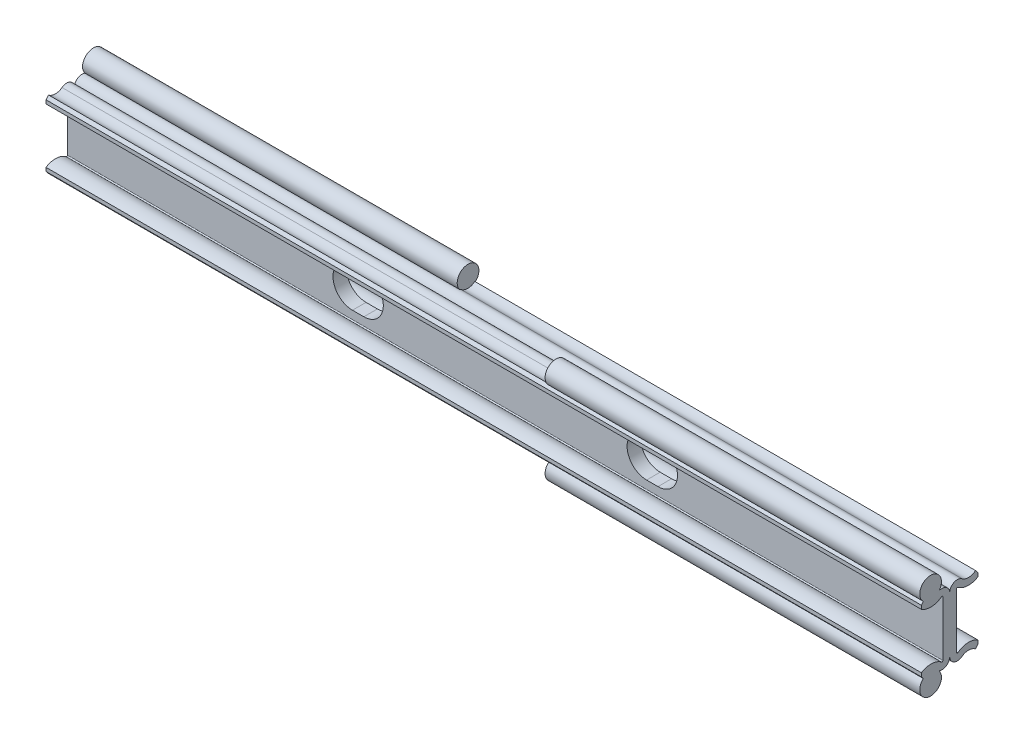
ISO-10303-21;
HEADER;
FILE_DESCRIPTION(('STEP AP214'),'2;1');
FILE_NAME('part.step','',(''),(''),'','','');
FILE_SCHEMA(('AUTOMOTIVE_DESIGN { 1 0 10303 214 1 1 1 1 }'));
ENDSEC;
DATA;
#1=APPLICATION_CONTEXT('core data for automotive mechanical design processes');
#2=APPLICATION_PROTOCOL_DEFINITION('international standard','automotive_design',2000,#1);
#3=PRODUCT_CONTEXT('',#1,'mechanical');
#4=PRODUCT('Part','Part','',(#3));
#5=PRODUCT_RELATED_PRODUCT_CATEGORY('part','',(#4));
#6=PRODUCT_DEFINITION_FORMATION('','',#4);
#7=PRODUCT_DEFINITION_CONTEXT('part definition',#1,'design');
#8=PRODUCT_DEFINITION('design','',#6,#7);
#9=PRODUCT_DEFINITION_SHAPE('','',#8);
#10=(LENGTH_UNIT() NAMED_UNIT(*) SI_UNIT(.MILLI.,.METRE.));
#11=(NAMED_UNIT(*) PLANE_ANGLE_UNIT() SI_UNIT($,.RADIAN.));
#12=(NAMED_UNIT(*) SI_UNIT($,.STERADIAN.) SOLID_ANGLE_UNIT());
#13=UNCERTAINTY_MEASURE_WITH_UNIT(LENGTH_MEASURE(1.E-05),#10,'distance_accuracy_value','');
#14=(GEOMETRIC_REPRESENTATION_CONTEXT(3) GLOBAL_UNCERTAINTY_ASSIGNED_CONTEXT((#13)) GLOBAL_UNIT_ASSIGNED_CONTEXT((#10,
#11,#12)) REPRESENTATION_CONTEXT('',''));
#15=CARTESIAN_POINT('',(0.,0.,0.));
#16=DIRECTION('',(0.,0.,1.));
#17=DIRECTION('',(1.,0.,0.));
#18=AXIS2_PLACEMENT_3D('',#15,#16,#17);
#19=CARTESIAN_POINT('',(100.,9.67000022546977,-4.31000011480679));
#20=DIRECTION('',(-1.,0.,0.));
#21=DIRECTION('',(0.,0.,1.));
#22=AXIS2_PLACEMENT_3D('',#19,#20,#21);
#23=CYLINDRICAL_SURFACE('',#22,2.48000011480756);
#24=CARTESIAN_POINT('',(-14.4,9.67000022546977,-4.31000011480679));
#25=DIRECTION('',(-1.,0.,0.));
#26=DIRECTION('',(0.,0.,1.));
#27=AXIS2_PLACEMENT_3D('',#24,#25,#26);
#28=CIRCLE('',#27,2.48000011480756);
#29=CARTESIAN_POINT('',(-14.4,7.69573962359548,-2.80910183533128));
#30=VERTEX_POINT('',#29);
#31=CARTESIAN_POINT('',(-14.4,7.77020990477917,-5.90411344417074));
#32=VERTEX_POINT('',#31);
#33=EDGE_CURVE('E323',#30,#32,#28,.F.);
#34=ORIENTED_EDGE('',*,*,#33,.F.);
#35=DIRECTION('',(-1.,0.,0.));
#36=VECTOR('',#35,1.);
#37=CARTESIAN_POINT('',(100.,7.69573962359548,-2.80910183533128));
#38=LINE('',#37,#36);
#39=CARTESIAN_POINT('',(100.,7.69573962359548,-2.80910183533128));
#40=VERTEX_POINT('',#39);
#41=EDGE_CURVE('E545',#40,#30,#38,.T.);
#42=ORIENTED_EDGE('',*,*,#41,.F.);
#43=CARTESIAN_POINT('',(100.,9.67000022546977,-4.31000011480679));
#44=DIRECTION('',(-1.,0.,0.));
#45=DIRECTION('',(0.,0.,1.));
#46=AXIS2_PLACEMENT_3D('',#43,#44,#45);
#47=CIRCLE('',#46,2.48000011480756);
#48=CARTESIAN_POINT('',(100.,7.77020990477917,-5.90411344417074));
#49=VERTEX_POINT('',#48);
#50=EDGE_CURVE('E506',#49,#40,#47,.T.);
#51=ORIENTED_EDGE('',*,*,#50,.F.);
#52=DIRECTION('',(-1.,0.,0.));
#53=VECTOR('',#52,1.);
#54=CARTESIAN_POINT('',(100.,7.77020990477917,-5.90411344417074));
#55=LINE('',#54,#53);
#56=EDGE_CURVE('E548',#49,#32,#55,.T.);
#57=ORIENTED_EDGE('',*,*,#56,.T.);
#58=EDGE_LOOP('',(#34,#42,#51,#57));
#59=FACE_BOUND('',#58,.T.);
#60=ADVANCED_FACE('F14',(#59),#23,.F.);
#61=CARTESIAN_POINT('',(100.,9.67000022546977,4.31000011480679));
#62=DIRECTION('',(-1.,0.,0.));
#63=DIRECTION('',(0.,0.,1.));
#64=AXIS2_PLACEMENT_3D('',#61,#62,#63);
#65=CYLINDRICAL_SURFACE('',#64,2.48000011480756);
#66=CARTESIAN_POINT('',(14.4,9.67000022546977,4.31000011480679));
#67=DIRECTION('',(1.,0.,0.));
#68=DIRECTION('',(0.,0.,-1.));
#69=AXIS2_PLACEMENT_3D('',#66,#67,#68);
#70=CIRCLE('',#69,2.48000011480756);
#71=CARTESIAN_POINT('',(14.4,7.69573962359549,2.80910183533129));
#72=VERTEX_POINT('',#71);
#73=CARTESIAN_POINT('',(14.4,7.77020990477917,5.90411344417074));
#74=VERTEX_POINT('',#73);
#75=EDGE_CURVE('E357',#72,#74,#70,.F.);
#76=ORIENTED_EDGE('',*,*,#75,.F.);
#77=DIRECTION('',(-1.,0.,0.));
#78=VECTOR('',#77,1.);
#79=CARTESIAN_POINT('',(100.,7.69573962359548,2.80910183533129));
#80=LINE('',#79,#78);
#81=CARTESIAN_POINT('',(-100.,7.69573962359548,2.80910183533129));
#82=VERTEX_POINT('',#81);
#83=EDGE_CURVE('E540',#72,#82,#80,.T.);
#84=ORIENTED_EDGE('',*,*,#83,.T.);
#85=CARTESIAN_POINT('',(-100.,9.67000022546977,4.31000011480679));
#86=DIRECTION('',(-1.,0.,0.));
#87=DIRECTION('',(0.,0.,-1.));
#88=AXIS2_PLACEMENT_3D('',#85,#86,#87);
#89=CIRCLE('',#88,2.48000011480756);
#90=CARTESIAN_POINT('',(-100.,7.77020990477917,5.90411344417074));
#91=VERTEX_POINT('',#90);
#92=EDGE_CURVE('E459',#82,#91,#89,.T.);
#93=ORIENTED_EDGE('',*,*,#92,.T.);
#94=DIRECTION('',(-1.,0.,0.));
#95=VECTOR('',#94,1.);
#96=CARTESIAN_POINT('',(100.,7.77020990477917,5.90411344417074));
#97=LINE('',#96,#95);
#98=EDGE_CURVE('E538',#74,#91,#97,.T.);
#99=ORIENTED_EDGE('',*,*,#98,.F.);
#100=EDGE_LOOP('',(#76,#84,#93,#99));
#101=FACE_BOUND('',#100,.T.);
#102=ADVANCED_FACE('F681',(#101),#65,.F.);
#103=CARTESIAN_POINT('',(100.,-6.30261222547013,1.75000011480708));
#104=DIRECTION('',(-1.,0.,0.));
#105=DIRECTION('',(0.,0.,1.));
#106=AXIS2_PLACEMENT_3D('',#103,#104,#105);
#107=CYLINDRICAL_SURFACE('',#106,0.200000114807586);
#108=CARTESIAN_POINT('',(-100.,-6.30261222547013,1.75000011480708));
#109=DIRECTION('',(-1.,0.,0.));
#110=DIRECTION('',(0.,0.,1.));
#111=AXIS2_PLACEMENT_3D('',#108,#109,#110);
#112=CIRCLE('',#111,0.200000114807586);
#113=CARTESIAN_POINT('',(-100.,-6.30261222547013,1.54999999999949));
#114=VERTEX_POINT('',#113);
#115=CARTESIAN_POINT('',(-100.,-6.46182696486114,1.87104024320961));
#116=VERTEX_POINT('',#115);
#117=EDGE_CURVE('E423',#114,#116,#112,.T.);
#118=ORIENTED_EDGE('',*,*,#117,.T.);
#119=DIRECTION('',(-1.,0.,0.));
#120=VECTOR('',#119,1.);
#121=CARTESIAN_POINT('',(100.,-6.46182696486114,1.87104024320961));
#122=LINE('',#121,#120);
#123=CARTESIAN_POINT('',(100.,-6.46182696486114,1.87104024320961));
#124=VERTEX_POINT('',#123);
#125=EDGE_CURVE('E591',#124,#116,#122,.T.);
#126=ORIENTED_EDGE('',*,*,#125,.F.);
#127=CARTESIAN_POINT('',(100.,-6.30261222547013,1.75000011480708));
#128=DIRECTION('',(-1.,0.,0.));
#129=DIRECTION('',(0.,0.,1.));
#130=AXIS2_PLACEMENT_3D('',#127,#128,#129);
#131=CIRCLE('',#130,0.200000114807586);
#132=CARTESIAN_POINT('',(100.,-6.30261222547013,1.54999999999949));
#133=VERTEX_POINT('',#132);
#134=EDGE_CURVE('E472',#133,#124,#131,.T.);
#135=ORIENTED_EDGE('',*,*,#134,.F.);
#136=DIRECTION('',(-1.,0.,0.));
#137=VECTOR('',#136,1.);
#138=CARTESIAN_POINT('',(100.,-6.30261222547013,1.54999999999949));
#139=LINE('',#138,#137);
#140=EDGE_CURVE('E523',#133,#114,#139,.T.);
#141=ORIENTED_EDGE('',*,*,#140,.T.);
#142=EDGE_LOOP('',(#118,#126,#135,#141));
#143=FACE_BOUND('',#142,.T.);
#144=ADVANCED_FACE('F16',(#143),#107,.F.);
#145=CARTESIAN_POINT('',(100.,-9.67000022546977,4.31000011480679));
#146=DIRECTION('',(-1.,0.,0.));
#147=DIRECTION('',(0.,0.,1.));
#148=AXIS2_PLACEMENT_3D('',#145,#146,#147);
#149=CYLINDRICAL_SURFACE('',#148,4.03000011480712);
#150=CARTESIAN_POINT('',(-100.,-9.67000022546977,4.31000011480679));
#151=DIRECTION('',(1.,0.,0.));
#152=DIRECTION('',(0.,0.,1.));
#153=AXIS2_PLACEMENT_3D('',#150,#151,#152);
#154=CIRCLE('',#153,4.03000011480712);
#155=CARTESIAN_POINT('',(-100.,-6.26775086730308,6.47000016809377));
#156=VERTEX_POINT('',#155);
#157=EDGE_CURVE('E426',#116,#156,#154,.T.);
#158=ORIENTED_EDGE('',*,*,#157,.T.);
#159=DIRECTION('',(-1.,0.,0.));
#160=VECTOR('',#159,1.);
#161=CARTESIAN_POINT('',(100.,-6.26775086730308,6.47000016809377));
#162=LINE('',#161,#160);
#163=CARTESIAN_POINT('',(100.,-6.26775086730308,6.47000016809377));
#164=VERTEX_POINT('',#163);
#165=EDGE_CURVE('E588',#164,#156,#162,.T.);
#166=ORIENTED_EDGE('',*,*,#165,.F.);
#167=CARTESIAN_POINT('',(100.,-9.67000022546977,4.31000011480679));
#168=DIRECTION('',(1.,0.,0.));
#169=DIRECTION('',(0.,0.,1.));
#170=AXIS2_PLACEMENT_3D('',#167,#168,#169);
#171=CIRCLE('',#170,4.03000011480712);
#172=EDGE_CURVE('E475',#124,#164,#171,.T.);
#173=ORIENTED_EDGE('',*,*,#172,.F.);
#174=ORIENTED_EDGE('',*,*,#125,.T.);
#175=EDGE_LOOP('',(#158,#166,#173,#174));
#176=FACE_BOUND('',#175,.T.);
#177=ADVANCED_FACE('F729',(#176),#149,.T.);
#178=CARTESIAN_POINT('',(100.,-6.26775086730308,6.47000016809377));
#179=DIRECTION('',(0.,0.,-1.));
#180=DIRECTION('',(-1.,0.,0.));
#181=AXIS2_PLACEMENT_3D('',#178,#179,#180);
#182=PLANE('',#181);
#183=DIRECTION('',(0.,-1.,0.));
#184=VECTOR('',#183,1.);
#185=CARTESIAN_POINT('',(-100.,-6.26775086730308,6.47000016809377));
#186=LINE('',#185,#184);
#187=CARTESIAN_POINT('',(-100.,-7.09581212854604,6.47000016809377));
#188=VERTEX_POINT('',#187);
#189=EDGE_CURVE('E428',#156,#188,#186,.T.);
#190=ORIENTED_EDGE('',*,*,#189,.T.);
#191=DIRECTION('',(-1.,0.,0.));
#192=VECTOR('',#191,1.);
#193=CARTESIAN_POINT('',(100.,-7.09581212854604,6.47000016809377));
#194=LINE('',#193,#192);
#195=CARTESIAN_POINT('',(100.,-7.09581212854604,6.47000016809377));
#196=VERTEX_POINT('',#195);
#197=EDGE_CURVE('E585',#196,#188,#194,.T.);
#198=ORIENTED_EDGE('',*,*,#197,.F.);
#199=DIRECTION('',(0.,-1.,0.));
#200=VECTOR('',#199,1.);
#201=CARTESIAN_POINT('',(100.,-6.26775086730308,6.47000016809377));
#202=LINE('',#201,#200);
#203=EDGE_CURVE('E477',#164,#196,#202,.T.);
#204=ORIENTED_EDGE('',*,*,#203,.F.);
#205=ORIENTED_EDGE('',*,*,#165,.T.);
#206=EDGE_LOOP('',(#190,#198,#204,#205));
#207=FACE_BOUND('',#206,.T.);
#208=ADVANCED_FACE('F726',(#207),#182,.F.);
#209=CARTESIAN_POINT('',(100.,-7.77020990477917,5.90411344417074));
#210=DIRECTION('',(0.,0.642787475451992,-0.766044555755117));
#211=DIRECTION('',(0.,0.766044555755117,0.642787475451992));
#212=AXIS2_PLACEMENT_3D('',#209,#210,#211);
#213=PLANE('',#212);
#214=DIRECTION('',(0.,0.766044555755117,0.642787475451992));
#215=VECTOR('',#214,1.);
#216=CARTESIAN_POINT('',(14.4,-7.77020990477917,5.90411344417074));
#217=LINE('',#216,#215);
#218=CARTESIAN_POINT('',(14.4,-7.77020990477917,5.90411344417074));
#219=VERTEX_POINT('',#218);
#220=CARTESIAN_POINT('',(14.4,-7.62948341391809,6.02219694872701));
#221=VERTEX_POINT('',#220);
#222=EDGE_CURVE('E343',#219,#221,#217,.T.);
#223=ORIENTED_EDGE('',*,*,#222,.T.);
#224=DIRECTION('',(1.,0.,0.));
#225=VECTOR('',#224,1.);
#226=CARTESIAN_POINT('',(14.4,-7.62948341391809,6.02219694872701));
#227=LINE('',#226,#225);
#228=CARTESIAN_POINT('',(100.,-7.62948341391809,6.02219694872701));
#229=VERTEX_POINT('',#228);
#230=EDGE_CURVE('E337',#221,#229,#227,.T.);
#231=ORIENTED_EDGE('',*,*,#230,.T.);
#232=DIRECTION('',(0.,-0.766044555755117,-0.642787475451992));
#233=VECTOR('',#232,1.);
#234=CARTESIAN_POINT('',(100.,-7.77020990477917,5.90411344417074));
#235=LINE('',#234,#233);
#236=EDGE_CURVE('E479',#196,#229,#235,.T.);
#237=ORIENTED_EDGE('',*,*,#236,.F.);
#238=ORIENTED_EDGE('',*,*,#197,.T.);
#239=DIRECTION('',(0.,-0.766044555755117,-0.642787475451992));
#240=VECTOR('',#239,1.);
#241=CARTESIAN_POINT('',(-100.,-7.77020990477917,5.90411344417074));
#242=LINE('',#241,#240);
#243=CARTESIAN_POINT('',(-100.,-7.77020990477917,5.90411344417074));
#244=VERTEX_POINT('',#243);
#245=EDGE_CURVE('E430',#188,#244,#242,.T.);
#246=ORIENTED_EDGE('',*,*,#245,.T.);
#247=DIRECTION('',(-1.,0.,0.));
#248=VECTOR('',#247,1.);
#249=CARTESIAN_POINT('',(100.,-7.77020990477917,5.90411344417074));
#250=LINE('',#249,#248);
#251=EDGE_CURVE('E583',#219,#244,#250,.T.);
#252=ORIENTED_EDGE('',*,*,#251,.F.);
#253=EDGE_LOOP('',(#223,#231,#237,#238,#246,#252));
#254=FACE_BOUND('',#253,.T.);
#255=ADVANCED_FACE('F722',(#254),#213,.F.);
#256=CARTESIAN_POINT('',(100.,-9.67000022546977,4.31000011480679));
#257=DIRECTION('',(-1.,0.,0.));
#258=DIRECTION('',(0.,0.,1.));
#259=AXIS2_PLACEMENT_3D('',#256,#257,#258);
#260=CYLINDRICAL_SURFACE('',#259,2.48000011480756);
#261=DIRECTION('',(-1.,0.,0.));
#262=VECTOR('',#261,1.);
#263=CARTESIAN_POINT('',(100.,-7.69573962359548,2.80910183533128));
#264=LINE('',#263,#262);
#265=CARTESIAN_POINT('',(14.4,-7.69573962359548,2.80910183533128));
#266=VERTEX_POINT('',#265);
#267=CARTESIAN_POINT('',(-100.,-7.69573962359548,2.80910183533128));
#268=VERTEX_POINT('',#267);
#269=EDGE_CURVE('E581',#266,#268,#264,.T.);
#270=ORIENTED_EDGE('',*,*,#269,.F.);
#271=CARTESIAN_POINT('',(14.4,-9.67000022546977,4.31000011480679));
#272=DIRECTION('',(-1.,0.,0.));
#273=DIRECTION('',(0.,0.,1.));
#274=AXIS2_PLACEMENT_3D('',#271,#272,#273);
#275=CIRCLE('',#274,2.48000011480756);
#276=EDGE_CURVE('E340',#266,#219,#275,.F.);
#277=ORIENTED_EDGE('',*,*,#276,.T.);
#278=ORIENTED_EDGE('',*,*,#251,.T.);
#279=CARTESIAN_POINT('',(-100.,-9.67000022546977,4.31000011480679));
#280=DIRECTION('',(-1.,0.,0.));
#281=DIRECTION('',(0.,0.,1.));
#282=AXIS2_PLACEMENT_3D('',#279,#280,#281);
#283=CIRCLE('',#282,2.48000011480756);
#284=EDGE_CURVE('E433',#244,#268,#283,.T.);
#285=ORIENTED_EDGE('',*,*,#284,.T.);
#286=EDGE_LOOP('',(#270,#277,#278,#285));
#287=FACE_BOUND('',#286,.T.);
#288=ADVANCED_FACE('F718',(#287),#260,.F.);
#289=CARTESIAN_POINT('',(100.,-6.30261222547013,1.75000011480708));
#290=DIRECTION('',(-1.,0.,0.));
#291=DIRECTION('',(0.,0.,1.));
#292=AXIS2_PLACEMENT_3D('',#289,#290,#291);
#293=CYLINDRICAL_SURFACE('',#292,1.75000011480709);
#294=CARTESIAN_POINT('',(100.,-6.30261222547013,1.75000011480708));
#295=DIRECTION('',(1.,0.,0.));
#296=DIRECTION('',(0.,0.,1.));
#297=AXIS2_PLACEMENT_3D('',#294,#295,#296);
#298=CIRCLE('',#297,1.75000011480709);
#299=CARTESIAN_POINT('',(100.,-7.91637379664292,2.42695948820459));
#300=VERTEX_POINT('',#299);
#301=CARTESIAN_POINT('',(100.,-6.30261222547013,0.));
#302=VERTEX_POINT('',#301);
#303=EDGE_CURVE('E482',#300,#302,#298,.T.);
#304=ORIENTED_EDGE('',*,*,#303,.F.);
#305=DIRECTION('',(1.,0.,0.));
#306=VECTOR('',#305,1.);
#307=CARTESIAN_POINT('',(57.2,-7.91637379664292,2.42695948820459));
#308=LINE('',#307,#306);
#309=CARTESIAN_POINT('',(14.4,-7.91637379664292,2.42695948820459));
#310=VERTEX_POINT('',#309);
#311=EDGE_CURVE('E333',#300,#310,#308,.F.);
#312=ORIENTED_EDGE('',*,*,#311,.T.);
#313=CARTESIAN_POINT('',(14.4,-6.30261222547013,1.75000011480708));
#314=DIRECTION('',(-1.,0.,0.));
#315=DIRECTION('',(0.,0.,1.));
#316=AXIS2_PLACEMENT_3D('',#313,#314,#315);
#317=CIRCLE('',#316,1.75000011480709);
#318=EDGE_CURVE('E596',#310,#266,#317,.T.);
#319=ORIENTED_EDGE('',*,*,#318,.T.);
#320=ORIENTED_EDGE('',*,*,#269,.T.);
#321=CARTESIAN_POINT('',(-100.,-6.30261222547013,1.75000011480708));
#322=DIRECTION('',(1.,0.,0.));
#323=DIRECTION('',(0.,0.,1.));
#324=AXIS2_PLACEMENT_3D('',#321,#322,#323);
#325=CIRCLE('',#324,1.75000011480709);
#326=CARTESIAN_POINT('',(-100.,-6.30261222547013,0.));
#327=VERTEX_POINT('',#326);
#328=EDGE_CURVE('E436',#268,#327,#325,.T.);
#329=ORIENTED_EDGE('',*,*,#328,.T.);
#330=DIRECTION('',(-1.,0.,0.));
#331=VECTOR('',#330,1.);
#332=CARTESIAN_POINT('',(100.,-6.30261222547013,0.));
#333=LINE('',#332,#331);
#334=EDGE_CURVE('E578',#302,#327,#333,.T.);
#335=ORIENTED_EDGE('',*,*,#334,.F.);
#336=EDGE_LOOP('',(#304,#312,#319,#320,#329,#335));
#337=FACE_BOUND('',#336,.T.);
#338=ADVANCED_FACE('F715',(#337),#293,.T.);
#339=CARTESIAN_POINT('',(100.,-6.30261222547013,-1.75000011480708));
#340=DIRECTION('',(-1.,0.,0.));
#341=DIRECTION('',(0.,0.,1.));
#342=AXIS2_PLACEMENT_3D('',#339,#340,#341);
#343=CYLINDRICAL_SURFACE('',#342,1.75000011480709);
#344=CARTESIAN_POINT('',(-100.,-6.30261222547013,-1.75000011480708));
#345=DIRECTION('',(1.,0.,0.));
#346=DIRECTION('',(0.,0.,-1.));
#347=AXIS2_PLACEMENT_3D('',#344,#345,#346);
#348=CIRCLE('',#347,1.75000011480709);
#349=CARTESIAN_POINT('',(-100.,-7.91637379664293,-2.42695948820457));
#350=VERTEX_POINT('',#349);
#351=EDGE_CURVE('E292',#327,#350,#348,.T.);
#352=ORIENTED_EDGE('',*,*,#351,.T.);
#353=DIRECTION('',(-1.,0.,0.));
#354=VECTOR('',#353,1.);
#355=CARTESIAN_POINT('',(-57.2,-7.91637379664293,-2.42695948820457));
#356=LINE('',#355,#354);
#357=CARTESIAN_POINT('',(-14.4,-7.91637379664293,-2.42695948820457));
#358=VERTEX_POINT('',#357);
#359=EDGE_CURVE('E29',#350,#358,#356,.F.);
#360=ORIENTED_EDGE('',*,*,#359,.T.);
#361=CARTESIAN_POINT('',(-14.4,-6.30261222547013,-1.75000011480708));
#362=DIRECTION('',(1.,0.,0.));
#363=DIRECTION('',(0.,0.,-1.));
#364=AXIS2_PLACEMENT_3D('',#361,#362,#363);
#365=CIRCLE('',#364,1.75000011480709);
#366=CARTESIAN_POINT('',(-14.4,-7.69573962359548,-2.80910183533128));
#367=VERTEX_POINT('',#366);
#368=EDGE_CURVE('E33',#358,#367,#365,.T.);
#369=ORIENTED_EDGE('',*,*,#368,.T.);
#370=DIRECTION('',(-1.,0.,0.));
#371=VECTOR('',#370,1.);
#372=CARTESIAN_POINT('',(100.,-7.69573962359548,-2.80910183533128));
#373=LINE('',#372,#371);
#374=CARTESIAN_POINT('',(100.,-7.69573962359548,-2.80910183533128));
#375=VERTEX_POINT('',#374);
#376=EDGE_CURVE('E576',#375,#367,#373,.T.);
#377=ORIENTED_EDGE('',*,*,#376,.F.);
#378=CARTESIAN_POINT('',(100.,-6.30261222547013,-1.75000011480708));
#379=DIRECTION('',(1.,0.,0.));
#380=DIRECTION('',(0.,0.,-1.));
#381=AXIS2_PLACEMENT_3D('',#378,#379,#380);
#382=CIRCLE('',#381,1.75000011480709);
#383=EDGE_CURVE('E484',#302,#375,#382,.T.);
#384=ORIENTED_EDGE('',*,*,#383,.F.);
#385=ORIENTED_EDGE('',*,*,#334,.T.);
#386=EDGE_LOOP('',(#352,#360,#369,#377,#384,#385));
#387=FACE_BOUND('',#386,.T.);
#388=ADVANCED_FACE('F712',(#387),#343,.T.);
#389=CARTESIAN_POINT('',(100.,-9.67000022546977,-4.31000011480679));
#390=DIRECTION('',(-1.,0.,0.));
#391=DIRECTION('',(0.,0.,1.));
#392=AXIS2_PLACEMENT_3D('',#389,#390,#391);
#393=CYLINDRICAL_SURFACE('',#392,2.48000011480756);
#394=ORIENTED_EDGE('',*,*,#376,.T.);
#395=CARTESIAN_POINT('',(-14.4,-9.67000022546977,-4.31000011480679));
#396=DIRECTION('',(1.,0.,0.));
#397=DIRECTION('',(0.,0.,-1.));
#398=AXIS2_PLACEMENT_3D('',#395,#396,#397);
#399=CIRCLE('',#398,2.48000011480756);
#400=CARTESIAN_POINT('',(-14.4,-7.77020990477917,-5.90411344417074));
#401=VERTEX_POINT('',#400);
#402=EDGE_CURVE('E309',#367,#401,#399,.F.);
#403=ORIENTED_EDGE('',*,*,#402,.T.);
#404=DIRECTION('',(-1.,0.,0.));
#405=VECTOR('',#404,1.);
#406=CARTESIAN_POINT('',(100.,-7.77020990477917,-5.90411344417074));
#407=LINE('',#406,#405);
#408=CARTESIAN_POINT('',(100.,-7.77020990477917,-5.90411344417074));
#409=VERTEX_POINT('',#408);
#410=EDGE_CURVE('E574',#409,#401,#407,.T.);
#411=ORIENTED_EDGE('',*,*,#410,.F.);
#412=CARTESIAN_POINT('',(100.,-9.67000022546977,-4.31000011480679));
#413=DIRECTION('',(-1.,0.,0.));
#414=DIRECTION('',(0.,0.,-1.));
#415=AXIS2_PLACEMENT_3D('',#412,#413,#414);
#416=CIRCLE('',#415,2.48000011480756);
#417=EDGE_CURVE('E486',#375,#409,#416,.T.);
#418=ORIENTED_EDGE('',*,*,#417,.F.);
#419=EDGE_LOOP('',(#394,#403,#411,#418));
#420=FACE_BOUND('',#419,.T.);
#421=ADVANCED_FACE('F667',(#420),#393,.F.);
#422=CARTESIAN_POINT('',(100.,-7.77020990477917,-5.90411344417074));
#423=DIRECTION('',(0.,0.642787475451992,0.766044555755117));
#424=DIRECTION('',(0.,-0.766044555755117,0.642787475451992));
#425=AXIS2_PLACEMENT_3D('',#422,#423,#424);
#426=PLANE('',#425);
#427=DIRECTION('',(0.,0.766044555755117,-0.642787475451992));
#428=VECTOR('',#427,1.);
#429=CARTESIAN_POINT('',(-14.4,-7.77020990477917,-5.90411344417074));
#430=LINE('',#429,#428);
#431=CARTESIAN_POINT('',(-14.4,-7.62948341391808,-6.02219694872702));
#432=VERTEX_POINT('',#431);
#433=EDGE_CURVE('E9',#401,#432,#430,.T.);
#434=ORIENTED_EDGE('',*,*,#433,.T.);
#435=DIRECTION('',(-1.,0.,0.));
#436=VECTOR('',#435,1.);
#437=CARTESIAN_POINT('',(-14.4,-7.62948341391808,-6.02219694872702));
#438=LINE('',#437,#436);
#439=CARTESIAN_POINT('',(-100.,-7.62948341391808,-6.02219694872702));
#440=VERTEX_POINT('',#439);
#441=EDGE_CURVE('E295',#432,#440,#438,.T.);
#442=ORIENTED_EDGE('',*,*,#441,.T.);
#443=DIRECTION('',(0.,0.766044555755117,-0.642787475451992));
#444=VECTOR('',#443,1.);
#445=CARTESIAN_POINT('',(-100.,-7.77020990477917,-5.90411344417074));
#446=LINE('',#445,#444);
#447=CARTESIAN_POINT('',(-100.,-7.09581212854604,-6.47000016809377));
#448=VERTEX_POINT('',#447);
#449=EDGE_CURVE('E281',#440,#448,#446,.T.);
#450=ORIENTED_EDGE('',*,*,#449,.T.);
#451=DIRECTION('',(-1.,0.,0.));
#452=VECTOR('',#451,1.);
#453=CARTESIAN_POINT('',(100.,-7.09581212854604,-6.47000016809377));
#454=LINE('',#453,#452);
#455=CARTESIAN_POINT('',(100.,-7.09581212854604,-6.47000016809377));
#456=VERTEX_POINT('',#455);
#457=EDGE_CURVE('E572',#456,#448,#454,.T.);
#458=ORIENTED_EDGE('',*,*,#457,.F.);
#459=DIRECTION('',(0.,0.766044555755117,-0.642787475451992));
#460=VECTOR('',#459,1.);
#461=CARTESIAN_POINT('',(100.,-7.77020990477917,-5.90411344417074));
#462=LINE('',#461,#460);
#463=EDGE_CURVE('E488',#409,#456,#462,.T.);
#464=ORIENTED_EDGE('',*,*,#463,.F.);
#465=ORIENTED_EDGE('',*,*,#410,.T.);
#466=EDGE_LOOP('',(#434,#442,#450,#458,#464,#465));
#467=FACE_BOUND('',#466,.T.);
#468=ADVANCED_FACE('F296',(#467),#426,.F.);
#469=CARTESIAN_POINT('',(100.,-6.26775086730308,-6.47000016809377));
#470=DIRECTION('',(0.,0.,1.));
#471=DIRECTION('',(1.,0.,0.));
#472=AXIS2_PLACEMENT_3D('',#469,#470,#471);
#473=PLANE('',#472);
#474=DIRECTION('',(0.,1.,0.));
#475=VECTOR('',#474,1.);
#476=CARTESIAN_POINT('',(-100.,-6.26775086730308,-6.47000016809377));
#477=LINE('',#476,#475);
#478=CARTESIAN_POINT('',(-100.,-6.26775086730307,-6.47000016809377));
#479=VERTEX_POINT('',#478);
#480=EDGE_CURVE('E288',#448,#479,#477,.T.);
#481=ORIENTED_EDGE('',*,*,#480,.T.);
#482=DIRECTION('',(-1.,0.,0.));
#483=VECTOR('',#482,1.);
#484=CARTESIAN_POINT('',(100.,-6.26775086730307,-6.47000016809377));
#485=LINE('',#484,#483);
#486=CARTESIAN_POINT('',(100.,-6.26775086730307,-6.47000016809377));
#487=VERTEX_POINT('',#486);
#488=EDGE_CURVE('E569',#487,#479,#485,.T.);
#489=ORIENTED_EDGE('',*,*,#488,.F.);
#490=DIRECTION('',(0.,1.,0.));
#491=VECTOR('',#490,1.);
#492=CARTESIAN_POINT('',(100.,-6.26775086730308,-6.47000016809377));
#493=LINE('',#492,#491);
#494=EDGE_CURVE('E490',#456,#487,#493,.T.);
#495=ORIENTED_EDGE('',*,*,#494,.F.);
#496=ORIENTED_EDGE('',*,*,#457,.T.);
#497=EDGE_LOOP('',(#481,#489,#495,#496));
#498=FACE_BOUND('',#497,.T.);
#499=ADVANCED_FACE('F661',(#498),#473,.F.);
#500=CARTESIAN_POINT('',(100.,-9.67000022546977,-4.31000011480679));
#501=DIRECTION('',(-1.,0.,0.));
#502=DIRECTION('',(0.,0.,1.));
#503=AXIS2_PLACEMENT_3D('',#500,#501,#502);
#504=CYLINDRICAL_SURFACE('',#503,4.03000011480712);
#505=CARTESIAN_POINT('',(-100.,-9.67000022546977,-4.31000011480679));
#506=DIRECTION('',(1.,0.,0.));
#507=DIRECTION('',(0.,0.,-1.));
#508=AXIS2_PLACEMENT_3D('',#505,#506,#507);
#509=CIRCLE('',#508,4.03000011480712);
#510=CARTESIAN_POINT('',(-100.,-6.46182696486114,-1.87104024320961));
#511=VERTEX_POINT('',#510);
#512=EDGE_CURVE('E440',#479,#511,#509,.T.);
#513=ORIENTED_EDGE('',*,*,#512,.T.);
#514=DIRECTION('',(-1.,0.,0.));
#515=VECTOR('',#514,1.);
#516=CARTESIAN_POINT('',(100.,-6.46182696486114,-1.87104024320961));
#517=LINE('',#516,#515);
#518=CARTESIAN_POINT('',(100.,-6.46182696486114,-1.87104024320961));
#519=VERTEX_POINT('',#518);
#520=EDGE_CURVE('E566',#519,#511,#517,.T.);
#521=ORIENTED_EDGE('',*,*,#520,.F.);
#522=CARTESIAN_POINT('',(100.,-9.67000022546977,-4.31000011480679));
#523=DIRECTION('',(1.,0.,0.));
#524=DIRECTION('',(0.,0.,-1.));
#525=AXIS2_PLACEMENT_3D('',#522,#523,#524);
#526=CIRCLE('',#525,4.03000011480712);
#527=EDGE_CURVE('E492',#487,#519,#526,.T.);
#528=ORIENTED_EDGE('',*,*,#527,.F.);
#529=ORIENTED_EDGE('',*,*,#488,.T.);
#530=EDGE_LOOP('',(#513,#521,#528,#529));
#531=FACE_BOUND('',#530,.T.);
#532=ADVANCED_FACE('F657',(#531),#504,.T.);
#533=CARTESIAN_POINT('',(100.,-6.30261222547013,-1.75000011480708));
#534=DIRECTION('',(-1.,0.,0.));
#535=DIRECTION('',(0.,0.,1.));
#536=AXIS2_PLACEMENT_3D('',#533,#534,#535);
#537=CYLINDRICAL_SURFACE('',#536,0.200000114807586);
#538=CARTESIAN_POINT('',(-100.,-6.30261222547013,-1.75000011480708));
#539=DIRECTION('',(-1.,0.,0.));
#540=DIRECTION('',(0.,0.,-1.));
#541=AXIS2_PLACEMENT_3D('',#538,#539,#540);
#542=CIRCLE('',#541,0.200000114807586);
#543=CARTESIAN_POINT('',(-100.,-6.30261222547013,-1.54999999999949));
#544=VERTEX_POINT('',#543);
#545=EDGE_CURVE('E442',#511,#544,#542,.T.);
#546=ORIENTED_EDGE('',*,*,#545,.T.);
#547=DIRECTION('',(-1.,0.,0.));
#548=VECTOR('',#547,1.);
#549=CARTESIAN_POINT('',(100.,-6.30261222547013,-1.54999999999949));
#550=LINE('',#549,#548);
#551=CARTESIAN_POINT('',(100.,-6.30261222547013,-1.54999999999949));
#552=VERTEX_POINT('',#551);
#553=EDGE_CURVE('E563',#552,#544,#550,.T.);
#554=ORIENTED_EDGE('',*,*,#553,.F.);
#555=CARTESIAN_POINT('',(100.,-6.30261222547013,-1.75000011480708));
#556=DIRECTION('',(-1.,0.,0.));
#557=DIRECTION('',(0.,0.,-1.));
#558=AXIS2_PLACEMENT_3D('',#555,#556,#557);
#559=CIRCLE('',#558,0.200000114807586);
#560=EDGE_CURVE('E494',#519,#552,#559,.T.);
#561=ORIENTED_EDGE('',*,*,#560,.F.);
#562=ORIENTED_EDGE('',*,*,#520,.T.);
#563=EDGE_LOOP('',(#546,#554,#561,#562));
#564=FACE_BOUND('',#563,.T.);
#565=ADVANCED_FACE('F652',(#564),#537,.F.);
#566=CARTESIAN_POINT('',(100.,-6.30261222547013,-1.54999999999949));
#567=DIRECTION('',(0.,0.,1.));
#568=DIRECTION('',(1.,0.,0.));
#569=AXIS2_PLACEMENT_3D('',#566,#567,#568);
#570=PLANE('',#569);
#571=DIRECTION('',(-1.,0.,0.));
#572=VECTOR('',#571,1.);
#573=CARTESIAN_POINT('',(34.9,-4.45,-1.54999999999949));
#574=LINE('',#573,#572);
#575=CARTESIAN_POINT('',(34.9,-4.45,-1.54999999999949));
#576=VERTEX_POINT('',#575);
#577=CARTESIAN_POINT('',(32.3,-4.45,-1.54999999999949));
#578=VERTEX_POINT('',#577);
#579=EDGE_CURVE('E371',#576,#578,#574,.T.);
#580=ORIENTED_EDGE('',*,*,#579,.F.);
#581=CARTESIAN_POINT('',(34.9,0.,-1.54999999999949));
#582=DIRECTION('',(0.,0.,-1.));
#583=DIRECTION('',(1.,0.,0.));
#584=AXIS2_PLACEMENT_3D('',#581,#582,#583);
#585=CIRCLE('',#584,4.45);
#586=CARTESIAN_POINT('',(34.9,4.45,-1.54999999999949));
#587=VERTEX_POINT('',#586);
#588=EDGE_CURVE('E369',#587,#576,#585,.T.);
#589=ORIENTED_EDGE('',*,*,#588,.F.);
#590=DIRECTION('',(1.,0.,0.));
#591=VECTOR('',#590,1.);
#592=CARTESIAN_POINT('',(32.3,4.45,-1.54999999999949));
#593=LINE('',#592,#591);
#594=CARTESIAN_POINT('',(32.3,4.45,-1.54999999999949));
#595=VERTEX_POINT('',#594);
#596=EDGE_CURVE('E377',#595,#587,#593,.T.);
#597=ORIENTED_EDGE('',*,*,#596,.F.);
#598=CARTESIAN_POINT('',(32.3,0.,-1.54999999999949));
#599=DIRECTION('',(0.,0.,-1.));
#600=DIRECTION('',(1.,0.,0.));
#601=AXIS2_PLACEMENT_3D('',#598,#599,#600);
#602=CIRCLE('',#601,4.45);
#603=EDGE_CURVE('E374',#578,#595,#602,.T.);
#604=ORIENTED_EDGE('',*,*,#603,.F.);
#605=EDGE_LOOP('',(#580,#589,#597,#604));
#606=FACE_BOUND('',#605,.T.);
#607=DIRECTION('',(-1.,0.,0.));
#608=VECTOR('',#607,1.);
#609=CARTESIAN_POINT('',(-34.9,-4.45,-1.54999999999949));
#610=LINE('',#609,#608);
#611=CARTESIAN_POINT('',(-32.3,-4.45,-1.54999999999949));
#612=VERTEX_POINT('',#611);
#613=CARTESIAN_POINT('',(-34.9,-4.45,-1.54999999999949));
#614=VERTEX_POINT('',#613);
#615=EDGE_CURVE('E402',#612,#614,#610,.T.);
#616=ORIENTED_EDGE('',*,*,#615,.F.);
#617=CARTESIAN_POINT('',(-32.3,0.,-1.54999999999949));
#618=DIRECTION('',(0.,0.,-1.));
#619=DIRECTION('',(-1.,0.,0.));
#620=AXIS2_PLACEMENT_3D('',#617,#618,#619);
#621=CIRCLE('',#620,4.45);
#622=CARTESIAN_POINT('',(-32.3,4.45,-1.54999999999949));
#623=VERTEX_POINT('',#622);
#624=EDGE_CURVE('E400',#623,#612,#621,.T.);
#625=ORIENTED_EDGE('',*,*,#624,.F.);
#626=DIRECTION('',(1.,0.,0.));
#627=VECTOR('',#626,1.);
#628=CARTESIAN_POINT('',(-32.3,4.45,-1.54999999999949));
#629=LINE('',#628,#627);
#630=CARTESIAN_POINT('',(-34.9,4.45,-1.54999999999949));
#631=VERTEX_POINT('',#630);
#632=EDGE_CURVE('E408',#631,#623,#629,.T.);
#633=ORIENTED_EDGE('',*,*,#632,.F.);
#634=CARTESIAN_POINT('',(-34.9,0.,-1.54999999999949));
#635=DIRECTION('',(0.,0.,-1.));
#636=DIRECTION('',(-1.,0.,0.));
#637=AXIS2_PLACEMENT_3D('',#634,#635,#636);
#638=CIRCLE('',#637,4.45);
#639=EDGE_CURVE('E405',#614,#631,#638,.T.);
#640=ORIENTED_EDGE('',*,*,#639,.F.);
#641=EDGE_LOOP('',(#616,#625,#633,#640));
#642=FACE_BOUND('',#641,.T.);
#643=DIRECTION('',(0.,1.,0.));
#644=VECTOR('',#643,1.);
#645=CARTESIAN_POINT('',(-100.,-6.30261222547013,-1.54999999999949));
#646=LINE('',#645,#644);
#647=CARTESIAN_POINT('',(-100.,6.30261222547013,-1.54999999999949));
#648=VERTEX_POINT('',#647);
#649=EDGE_CURVE('E444',#544,#648,#646,.T.);
#650=ORIENTED_EDGE('',*,*,#649,.T.);
#651=DIRECTION('',(-1.,0.,0.));
#652=VECTOR('',#651,1.);
#653=CARTESIAN_POINT('',(100.,6.30261222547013,-1.54999999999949));
#654=LINE('',#653,#652);
#655=CARTESIAN_POINT('',(100.,6.30261222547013,-1.54999999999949));
#656=VERTEX_POINT('',#655);
#657=EDGE_CURVE('E560',#656,#648,#654,.T.);
#658=ORIENTED_EDGE('',*,*,#657,.F.);
#659=DIRECTION('',(0.,1.,0.));
#660=VECTOR('',#659,1.);
#661=CARTESIAN_POINT('',(100.,-6.30261222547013,-1.54999999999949));
#662=LINE('',#661,#660);
#663=EDGE_CURVE('E496',#552,#656,#662,.T.);
#664=ORIENTED_EDGE('',*,*,#663,.F.);
#665=ORIENTED_EDGE('',*,*,#553,.T.);
#666=EDGE_LOOP('',(#650,#658,#664,#665));
#667=FACE_BOUND('',#666,.T.);
#668=ADVANCED_FACE('F648',(#606,#642,#667),#570,.F.);
#669=CARTESIAN_POINT('',(100.,6.30261222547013,-1.75000011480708));
#670=DIRECTION('',(-1.,0.,0.));
#671=DIRECTION('',(0.,0.,1.));
#672=AXIS2_PLACEMENT_3D('',#669,#670,#671);
#673=CYLINDRICAL_SURFACE('',#672,0.200000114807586);
#674=CARTESIAN_POINT('',(-100.,6.30261222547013,-1.75000011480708));
#675=DIRECTION('',(-1.,0.,0.));
#676=DIRECTION('',(0.,0.,1.));
#677=AXIS2_PLACEMENT_3D('',#674,#675,#676);
#678=CIRCLE('',#677,0.200000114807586);
#679=CARTESIAN_POINT('',(-100.,6.46182696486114,-1.87104024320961));
#680=VERTEX_POINT('',#679);
#681=EDGE_CURVE('E446',#648,#680,#678,.T.);
#682=ORIENTED_EDGE('',*,*,#681,.T.);
#683=DIRECTION('',(-1.,0.,0.));
#684=VECTOR('',#683,1.);
#685=CARTESIAN_POINT('',(100.,6.46182696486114,-1.87104024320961));
#686=LINE('',#685,#684);
#687=CARTESIAN_POINT('',(100.,6.46182696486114,-1.87104024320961));
#688=VERTEX_POINT('',#687);
#689=EDGE_CURVE('E557',#688,#680,#686,.T.);
#690=ORIENTED_EDGE('',*,*,#689,.F.);
#691=CARTESIAN_POINT('',(100.,6.30261222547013,-1.75000011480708));
#692=DIRECTION('',(-1.,0.,0.));
#693=DIRECTION('',(0.,0.,1.));
#694=AXIS2_PLACEMENT_3D('',#691,#692,#693);
#695=CIRCLE('',#694,0.200000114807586);
#696=EDGE_CURVE('E498',#656,#688,#695,.T.);
#697=ORIENTED_EDGE('',*,*,#696,.F.);
#698=ORIENTED_EDGE('',*,*,#657,.T.);
#699=EDGE_LOOP('',(#682,#690,#697,#698));
#700=FACE_BOUND('',#699,.T.);
#701=ADVANCED_FACE('F644',(#700),#673,.F.);
#702=CARTESIAN_POINT('',(100.,9.67000022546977,-4.31000011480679));
#703=DIRECTION('',(-1.,0.,0.));
#704=DIRECTION('',(0.,0.,1.));
#705=AXIS2_PLACEMENT_3D('',#702,#703,#704);
#706=CYLINDRICAL_SURFACE('',#705,4.03000011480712);
#707=CARTESIAN_POINT('',(-100.,9.67000022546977,-4.31000011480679));
#708=DIRECTION('',(1.,0.,0.));
#709=DIRECTION('',(0.,0.,1.));
#710=AXIS2_PLACEMENT_3D('',#707,#708,#709);
#711=CIRCLE('',#710,4.03000011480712);
#712=CARTESIAN_POINT('',(-100.,6.26775086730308,-6.47000016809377));
#713=VERTEX_POINT('',#712);
#714=EDGE_CURVE('E448',#680,#713,#711,.T.);
#715=ORIENTED_EDGE('',*,*,#714,.T.);
#716=DIRECTION('',(-1.,0.,0.));
#717=VECTOR('',#716,1.);
#718=CARTESIAN_POINT('',(100.,6.26775086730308,-6.47000016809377));
#719=LINE('',#718,#717);
#720=CARTESIAN_POINT('',(100.,6.26775086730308,-6.47000016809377));
#721=VERTEX_POINT('',#720);
#722=EDGE_CURVE('E554',#721,#713,#719,.T.);
#723=ORIENTED_EDGE('',*,*,#722,.F.);
#724=CARTESIAN_POINT('',(100.,9.67000022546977,-4.31000011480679));
#725=DIRECTION('',(1.,0.,0.));
#726=DIRECTION('',(0.,0.,1.));
#727=AXIS2_PLACEMENT_3D('',#724,#725,#726);
#728=CIRCLE('',#727,4.03000011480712);
#729=EDGE_CURVE('E500',#688,#721,#728,.T.);
#730=ORIENTED_EDGE('',*,*,#729,.F.);
#731=ORIENTED_EDGE('',*,*,#689,.T.);
#732=EDGE_LOOP('',(#715,#723,#730,#731));
#733=FACE_BOUND('',#732,.T.);
#734=ADVANCED_FACE('F639',(#733),#706,.T.);
#735=CARTESIAN_POINT('',(100.,6.26775086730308,-6.47000016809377));
#736=DIRECTION('',(0.,0.,1.));
#737=DIRECTION('',(1.,0.,0.));
#738=AXIS2_PLACEMENT_3D('',#735,#736,#737);
#739=PLANE('',#738);
#740=DIRECTION('',(0.,1.,0.));
#741=VECTOR('',#740,1.);
#742=CARTESIAN_POINT('',(-100.,6.26775086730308,-6.47000016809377));
#743=LINE('',#742,#741);
#744=CARTESIAN_POINT('',(-100.,7.09581212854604,-6.47000016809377));
#745=VERTEX_POINT('',#744);
#746=EDGE_CURVE('E450',#713,#745,#743,.T.);
#747=ORIENTED_EDGE('',*,*,#746,.T.);
#748=DIRECTION('',(-1.,0.,0.));
#749=VECTOR('',#748,1.);
#750=CARTESIAN_POINT('',(100.,7.09581212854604,-6.47000016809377));
#751=LINE('',#750,#749);
#752=CARTESIAN_POINT('',(100.,7.09581212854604,-6.47000016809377));
#753=VERTEX_POINT('',#752);
#754=EDGE_CURVE('E551',#753,#745,#751,.T.);
#755=ORIENTED_EDGE('',*,*,#754,.F.);
#756=DIRECTION('',(0.,1.,0.));
#757=VECTOR('',#756,1.);
#758=CARTESIAN_POINT('',(100.,6.26775086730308,-6.47000016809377));
#759=LINE('',#758,#757);
#760=EDGE_CURVE('E502',#721,#753,#759,.T.);
#761=ORIENTED_EDGE('',*,*,#760,.F.);
#762=ORIENTED_EDGE('',*,*,#722,.T.);
#763=EDGE_LOOP('',(#747,#755,#761,#762));
#764=FACE_BOUND('',#763,.T.);
#765=ADVANCED_FACE('F633',(#764),#739,.F.);
#766=CARTESIAN_POINT('',(100.,7.77020990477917,-5.90411344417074));
#767=DIRECTION('',(0.,-0.642787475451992,0.766044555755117));
#768=DIRECTION('',(0.,-0.766044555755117,-0.642787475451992));
#769=AXIS2_PLACEMENT_3D('',#766,#767,#768);
#770=PLANE('',#769);
#771=DIRECTION('',(0.,0.766044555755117,0.642787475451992));
#772=VECTOR('',#771,1.);
#773=CARTESIAN_POINT('',(-100.,7.77020990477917,-5.90411344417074));
#774=LINE('',#773,#772);
#775=CARTESIAN_POINT('',(-100.,7.62948341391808,-6.02219694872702));
#776=VERTEX_POINT('',#775);
#777=EDGE_CURVE('E452',#745,#776,#774,.T.);
#778=ORIENTED_EDGE('',*,*,#777,.T.);
#779=DIRECTION('',(-1.,0.,0.));
#780=VECTOR('',#779,1.);
#781=CARTESIAN_POINT('',(-14.4,7.62948341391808,-6.02219694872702));
#782=LINE('',#781,#780);
#783=CARTESIAN_POINT('',(-14.4,7.62948341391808,-6.02219694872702));
#784=VERTEX_POINT('',#783);
#785=EDGE_CURVE('E321',#776,#784,#782,.F.);
#786=ORIENTED_EDGE('',*,*,#785,.T.);
#787=DIRECTION('',(0.,-0.766044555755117,-0.642787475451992));
#788=VECTOR('',#787,1.);
#789=CARTESIAN_POINT('',(-14.4,7.77020990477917,-5.90411344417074));
#790=LINE('',#789,#788);
#791=EDGE_CURVE('E326',#32,#784,#790,.T.);
#792=ORIENTED_EDGE('',*,*,#791,.F.);
#793=ORIENTED_EDGE('',*,*,#56,.F.);
#794=DIRECTION('',(0.,0.766044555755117,0.642787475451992));
#795=VECTOR('',#794,1.);
#796=CARTESIAN_POINT('',(100.,7.77020990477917,-5.90411344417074));
#797=LINE('',#796,#795);
#798=EDGE_CURVE('E504',#753,#49,#797,.T.);
#799=ORIENTED_EDGE('',*,*,#798,.F.);
#800=ORIENTED_EDGE('',*,*,#754,.T.);
#801=EDGE_LOOP('',(#778,#786,#792,#793,#799,#800));
#802=FACE_BOUND('',#801,.T.);
#803=ADVANCED_FACE('F629',(#802),#770,.F.);
#804=CARTESIAN_POINT('',(100.,6.30261222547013,-1.75000011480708));
#805=DIRECTION('',(-1.,0.,0.));
#806=DIRECTION('',(0.,0.,1.));
#807=AXIS2_PLACEMENT_3D('',#804,#805,#806);
#808=CYLINDRICAL_SURFACE('',#807,1.75000011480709);
#809=CARTESIAN_POINT('',(-14.4,6.30261222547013,-1.75000011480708));
#810=DIRECTION('',(-1.,0.,0.));
#811=DIRECTION('',(0.,0.,1.));
#812=AXIS2_PLACEMENT_3D('',#809,#810,#811);
#813=CIRCLE('',#812,1.75000011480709);
#814=CARTESIAN_POINT('',(-14.4,7.91637379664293,-2.42695948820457));
#815=VERTEX_POINT('',#814);
#816=EDGE_CURVE('E22',#815,#30,#813,.T.);
#817=ORIENTED_EDGE('',*,*,#816,.F.);
#818=DIRECTION('',(-1.,0.,0.));
#819=VECTOR('',#818,1.);
#820=CARTESIAN_POINT('',(-57.2,7.91637379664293,-2.42695948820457));
#821=LINE('',#820,#819);
#822=CARTESIAN_POINT('',(-100.,7.91637379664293,-2.42695948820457));
#823=VERTEX_POINT('',#822);
#824=EDGE_CURVE('E316',#815,#823,#821,.T.);
#825=ORIENTED_EDGE('',*,*,#824,.T.);
#826=CARTESIAN_POINT('',(-100.,6.30261222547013,-1.75000011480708));
#827=DIRECTION('',(1.,0.,0.));
#828=DIRECTION('',(0.,0.,1.));
#829=AXIS2_PLACEMENT_3D('',#826,#827,#828);
#830=CIRCLE('',#829,1.75000011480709);
#831=CARTESIAN_POINT('',(-100.,6.30261222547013,0.));
#832=VERTEX_POINT('',#831);
#833=EDGE_CURVE('E454',#823,#832,#830,.T.);
#834=ORIENTED_EDGE('',*,*,#833,.T.);
#835=DIRECTION('',(-1.,0.,0.));
#836=VECTOR('',#835,1.);
#837=CARTESIAN_POINT('',(100.,6.30261222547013,0.));
#838=LINE('',#837,#836);
#839=CARTESIAN_POINT('',(100.,6.30261222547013,0.));
#840=VERTEX_POINT('',#839);
#841=EDGE_CURVE('E542',#840,#832,#838,.T.);
#842=ORIENTED_EDGE('',*,*,#841,.F.);
#843=CARTESIAN_POINT('',(100.,6.30261222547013,-1.75000011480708));
#844=DIRECTION('',(1.,0.,0.));
#845=DIRECTION('',(0.,0.,1.));
#846=AXIS2_PLACEMENT_3D('',#843,#844,#845);
#847=CIRCLE('',#846,1.75000011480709);
#848=EDGE_CURVE('E508',#40,#840,#847,.T.);
#849=ORIENTED_EDGE('',*,*,#848,.F.);
#850=ORIENTED_EDGE('',*,*,#41,.T.);
#851=EDGE_LOOP('',(#817,#825,#834,#842,#849,#850));
#852=FACE_BOUND('',#851,.T.);
#853=ADVANCED_FACE('F604',(#852),#808,.T.);
#854=CARTESIAN_POINT('',(100.,6.30261222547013,1.75000011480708));
#855=DIRECTION('',(-1.,0.,0.));
#856=DIRECTION('',(0.,0.,1.));
#857=AXIS2_PLACEMENT_3D('',#854,#855,#856);
#858=CYLINDRICAL_SURFACE('',#857,1.75000011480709);
#859=CARTESIAN_POINT('',(14.4,6.30261222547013,1.75000011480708));
#860=DIRECTION('',(1.,0.,0.));
#861=DIRECTION('',(0.,0.,-1.));
#862=AXIS2_PLACEMENT_3D('',#859,#860,#861);
#863=CIRCLE('',#862,1.75000011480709);
#864=CARTESIAN_POINT('',(14.4,7.91637379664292,2.42695948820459));
#865=VERTEX_POINT('',#864);
#866=EDGE_CURVE('E359',#865,#72,#863,.T.);
#867=ORIENTED_EDGE('',*,*,#866,.F.);
#868=DIRECTION('',(1.,0.,0.));
#869=VECTOR('',#868,1.);
#870=CARTESIAN_POINT('',(57.2,7.91637379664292,2.42695948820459));
#871=LINE('',#870,#869);
#872=CARTESIAN_POINT('',(100.,7.91637379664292,2.42695948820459));
#873=VERTEX_POINT('',#872);
#874=EDGE_CURVE('E354',#865,#873,#871,.T.);
#875=ORIENTED_EDGE('',*,*,#874,.T.);
#876=CARTESIAN_POINT('',(100.,6.30261222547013,1.75000011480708));
#877=DIRECTION('',(1.,0.,0.));
#878=DIRECTION('',(0.,0.,-1.));
#879=AXIS2_PLACEMENT_3D('',#876,#877,#878);
#880=CIRCLE('',#879,1.75000011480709);
#881=EDGE_CURVE('E510',#840,#873,#880,.T.);
#882=ORIENTED_EDGE('',*,*,#881,.F.);
#883=ORIENTED_EDGE('',*,*,#841,.T.);
#884=CARTESIAN_POINT('',(-100.,6.30261222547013,1.75000011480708));
#885=DIRECTION('',(1.,0.,0.));
#886=DIRECTION('',(0.,0.,-1.));
#887=AXIS2_PLACEMENT_3D('',#884,#885,#886);
#888=CIRCLE('',#887,1.75000011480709);
#889=EDGE_CURVE('E456',#832,#82,#888,.T.);
#890=ORIENTED_EDGE('',*,*,#889,.T.);
#891=ORIENTED_EDGE('',*,*,#83,.F.);
#892=EDGE_LOOP('',(#867,#875,#882,#883,#890,#891));
#893=FACE_BOUND('',#892,.T.);
#894=ADVANCED_FACE('F619',(#893),#858,.T.);
#895=CARTESIAN_POINT('',(100.,7.77020990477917,5.90411344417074));
#896=DIRECTION('',(0.,-0.642787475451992,-0.766044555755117));
#897=DIRECTION('',(0.,0.766044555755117,-0.642787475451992));
#898=AXIS2_PLACEMENT_3D('',#895,#896,#897);
#899=PLANE('',#898);
#900=DIRECTION('',(0.,-0.766044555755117,0.642787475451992));
#901=VECTOR('',#900,1.);
#902=CARTESIAN_POINT('',(100.,7.77020990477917,5.90411344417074));
#903=LINE('',#902,#901);
#904=CARTESIAN_POINT('',(100.,7.62948341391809,6.02219694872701));
#905=VERTEX_POINT('',#904);
#906=CARTESIAN_POINT('',(100.,7.09581212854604,6.47000016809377));
#907=VERTEX_POINT('',#906);
#908=EDGE_CURVE('E513',#905,#907,#903,.T.);
#909=ORIENTED_EDGE('',*,*,#908,.F.);
#910=DIRECTION('',(1.,0.,0.));
#911=VECTOR('',#910,1.);
#912=CARTESIAN_POINT('',(14.4,7.62948341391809,6.02219694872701));
#913=LINE('',#912,#911);
#914=CARTESIAN_POINT('',(14.4,7.62948341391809,6.02219694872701));
#915=VERTEX_POINT('',#914);
#916=EDGE_CURVE('E350',#905,#915,#913,.F.);
#917=ORIENTED_EDGE('',*,*,#916,.T.);
#918=DIRECTION('',(0.,-0.766044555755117,0.642787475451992));
#919=VECTOR('',#918,1.);
#920=CARTESIAN_POINT('',(14.4,7.77020990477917,5.90411344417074));
#921=LINE('',#920,#919);
#922=EDGE_CURVE('E594',#74,#915,#921,.T.);
#923=ORIENTED_EDGE('',*,*,#922,.F.);
#924=ORIENTED_EDGE('',*,*,#98,.T.);
#925=DIRECTION('',(0.,-0.766044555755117,0.642787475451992));
#926=VECTOR('',#925,1.);
#927=CARTESIAN_POINT('',(-100.,7.77020990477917,5.90411344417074));
#928=LINE('',#927,#926);
#929=CARTESIAN_POINT('',(-100.,7.09581212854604,6.47000016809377));
#930=VERTEX_POINT('',#929);
#931=EDGE_CURVE('E462',#91,#930,#928,.T.);
#932=ORIENTED_EDGE('',*,*,#931,.T.);
#933=DIRECTION('',(-1.,0.,0.));
#934=VECTOR('',#933,1.);
#935=CARTESIAN_POINT('',(100.,7.09581212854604,6.47000016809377));
#936=LINE('',#935,#934);
#937=EDGE_CURVE('E535',#907,#930,#936,.T.);
#938=ORIENTED_EDGE('',*,*,#937,.F.);
#939=EDGE_LOOP('',(#909,#917,#923,#924,#932,#938));
#940=FACE_BOUND('',#939,.T.);
#941=ADVANCED_FACE('F774',(#940),#899,.F.);
#942=CARTESIAN_POINT('',(100.,6.26775086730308,6.47000016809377));
#943=DIRECTION('',(0.,0.,-1.));
#944=DIRECTION('',(-1.,0.,0.));
#945=AXIS2_PLACEMENT_3D('',#942,#943,#944);
#946=PLANE('',#945);
#947=DIRECTION('',(0.,-1.,0.));
#948=VECTOR('',#947,1.);
#949=CARTESIAN_POINT('',(-100.,6.26775086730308,6.47000016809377));
#950=LINE('',#949,#948);
#951=CARTESIAN_POINT('',(-100.,6.26775086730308,6.47000016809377));
#952=VERTEX_POINT('',#951);
#953=EDGE_CURVE('E464',#930,#952,#950,.T.);
#954=ORIENTED_EDGE('',*,*,#953,.T.);
#955=DIRECTION('',(-1.,0.,0.));
#956=VECTOR('',#955,1.);
#957=CARTESIAN_POINT('',(100.,6.26775086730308,6.47000016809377));
#958=LINE('',#957,#956);
#959=CARTESIAN_POINT('',(100.,6.26775086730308,6.47000016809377));
#960=VERTEX_POINT('',#959);
#961=EDGE_CURVE('E532',#960,#952,#958,.T.);
#962=ORIENTED_EDGE('',*,*,#961,.F.);
#963=DIRECTION('',(0.,-1.,0.));
#964=VECTOR('',#963,1.);
#965=CARTESIAN_POINT('',(100.,6.26775086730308,6.47000016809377));
#966=LINE('',#965,#964);
#967=EDGE_CURVE('E515',#907,#960,#966,.T.);
#968=ORIENTED_EDGE('',*,*,#967,.F.);
#969=ORIENTED_EDGE('',*,*,#937,.T.);
#970=EDGE_LOOP('',(#954,#962,#968,#969));
#971=FACE_BOUND('',#970,.T.);
#972=ADVANCED_FACE('F769',(#971),#946,.F.);
#973=CARTESIAN_POINT('',(100.,9.67000022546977,4.31000011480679));
#974=DIRECTION('',(-1.,0.,0.));
#975=DIRECTION('',(0.,0.,1.));
#976=AXIS2_PLACEMENT_3D('',#973,#974,#975);
#977=CYLINDRICAL_SURFACE('',#976,4.03000011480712);
#978=CARTESIAN_POINT('',(-100.,9.67000022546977,4.31000011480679));
#979=DIRECTION('',(1.,0.,0.));
#980=DIRECTION('',(0.,0.,-1.));
#981=AXIS2_PLACEMENT_3D('',#978,#979,#980);
#982=CIRCLE('',#981,4.03000011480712);
#983=CARTESIAN_POINT('',(-100.,6.46182696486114,1.87104024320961));
#984=VERTEX_POINT('',#983);
#985=EDGE_CURVE('E466',#952,#984,#982,.T.);
#986=ORIENTED_EDGE('',*,*,#985,.T.);
#987=DIRECTION('',(-1.,0.,0.));
#988=VECTOR('',#987,1.);
#989=CARTESIAN_POINT('',(100.,6.46182696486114,1.87104024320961));
#990=LINE('',#989,#988);
#991=CARTESIAN_POINT('',(100.,6.46182696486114,1.87104024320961));
#992=VERTEX_POINT('',#991);
#993=EDGE_CURVE('E529',#992,#984,#990,.T.);
#994=ORIENTED_EDGE('',*,*,#993,.F.);
#995=CARTESIAN_POINT('',(100.,9.67000022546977,4.31000011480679));
#996=DIRECTION('',(1.,0.,0.));
#997=DIRECTION('',(0.,0.,-1.));
#998=AXIS2_PLACEMENT_3D('',#995,#996,#997);
#999=CIRCLE('',#998,4.03000011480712);
#1000=EDGE_CURVE('E517',#960,#992,#999,.T.);
#1001=ORIENTED_EDGE('',*,*,#1000,.F.);
#1002=ORIENTED_EDGE('',*,*,#961,.T.);
#1003=EDGE_LOOP('',(#986,#994,#1001,#1002));
#1004=FACE_BOUND('',#1003,.T.);
#1005=ADVANCED_FACE('F764',(#1004),#977,.T.);
#1006=CARTESIAN_POINT('',(100.,6.30261222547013,1.75000011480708));
#1007=DIRECTION('',(-1.,0.,0.));
#1008=DIRECTION('',(0.,0.,1.));
#1009=AXIS2_PLACEMENT_3D('',#1006,#1007,#1008);
#1010=CYLINDRICAL_SURFACE('',#1009,0.200000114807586);
#1011=CARTESIAN_POINT('',(-100.,6.30261222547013,1.75000011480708));
#1012=DIRECTION('',(-1.,0.,0.));
#1013=DIRECTION('',(0.,0.,-1.));
#1014=AXIS2_PLACEMENT_3D('',#1011,#1012,#1013);
#1015=CIRCLE('',#1014,0.200000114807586);
#1016=CARTESIAN_POINT('',(-100.,6.30261222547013,1.54999999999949));
#1017=VERTEX_POINT('',#1016);
#1018=EDGE_CURVE('E468',#984,#1017,#1015,.T.);
#1019=ORIENTED_EDGE('',*,*,#1018,.T.);
#1020=DIRECTION('',(-1.,0.,0.));
#1021=VECTOR('',#1020,1.);
#1022=CARTESIAN_POINT('',(100.,6.30261222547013,1.54999999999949));
#1023=LINE('',#1022,#1021);
#1024=CARTESIAN_POINT('',(100.,6.30261222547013,1.54999999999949));
#1025=VERTEX_POINT('',#1024);
#1026=EDGE_CURVE('E526',#1025,#1017,#1023,.T.);
#1027=ORIENTED_EDGE('',*,*,#1026,.F.);
#1028=CARTESIAN_POINT('',(100.,6.30261222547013,1.75000011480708));
#1029=DIRECTION('',(-1.,0.,0.));
#1030=DIRECTION('',(0.,0.,-1.));
#1031=AXIS2_PLACEMENT_3D('',#1028,#1029,#1030);
#1032=CIRCLE('',#1031,0.200000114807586);
#1033=EDGE_CURVE('E519',#992,#1025,#1032,.T.);
#1034=ORIENTED_EDGE('',*,*,#1033,.F.);
#1035=ORIENTED_EDGE('',*,*,#993,.T.);
#1036=EDGE_LOOP('',(#1019,#1027,#1034,#1035));
#1037=FACE_BOUND('',#1036,.T.);
#1038=ADVANCED_FACE('F760',(#1037),#1010,.F.);
#1039=CARTESIAN_POINT('',(100.,-6.30261222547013,1.54999999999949));
#1040=DIRECTION('',(0.,0.,-1.));
#1041=DIRECTION('',(-1.,0.,0.));
#1042=AXIS2_PLACEMENT_3D('',#1039,#1040,#1041);
#1043=PLANE('',#1042);
#1044=DIRECTION('',(-1.,0.,0.));
#1045=VECTOR('',#1044,1.);
#1046=CARTESIAN_POINT('',(32.3,4.45,1.54999999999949));
#1047=LINE('',#1046,#1045);
#1048=CARTESIAN_POINT('',(34.9,4.45,1.54999999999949));
#1049=VERTEX_POINT('',#1048);
#1050=CARTESIAN_POINT('',(32.3,4.45,1.54999999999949));
#1051=VERTEX_POINT('',#1050);
#1052=EDGE_CURVE('E363',#1049,#1051,#1047,.T.);
#1053=ORIENTED_EDGE('',*,*,#1052,.F.);
#1054=CARTESIAN_POINT('',(34.9,0.,1.54999999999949));
#1055=DIRECTION('',(0.,0.,-1.));
#1056=DIRECTION('',(-1.,0.,0.));
#1057=AXIS2_PLACEMENT_3D('',#1054,#1055,#1056);
#1058=CIRCLE('',#1057,4.45);
#1059=CARTESIAN_POINT('',(34.9,-4.45,1.54999999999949));
#1060=VERTEX_POINT('',#1059);
#1061=EDGE_CURVE('E366',#1060,#1049,#1058,.F.);
#1062=ORIENTED_EDGE('',*,*,#1061,.F.);
#1063=DIRECTION('',(1.,0.,0.));
#1064=VECTOR('',#1063,1.);
#1065=CARTESIAN_POINT('',(34.9,-4.45,1.54999999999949));
#1066=LINE('',#1065,#1064);
#1067=CARTESIAN_POINT('',(32.3,-4.45,1.54999999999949));
#1068=VERTEX_POINT('',#1067);
#1069=EDGE_CURVE('E383',#1068,#1060,#1066,.T.);
#1070=ORIENTED_EDGE('',*,*,#1069,.F.);
#1071=CARTESIAN_POINT('',(32.3,0.,1.54999999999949));
#1072=DIRECTION('',(0.,0.,-1.));
#1073=DIRECTION('',(-1.,0.,0.));
#1074=AXIS2_PLACEMENT_3D('',#1071,#1072,#1073);
#1075=CIRCLE('',#1074,4.45);
#1076=EDGE_CURVE('E361',#1051,#1068,#1075,.F.);
#1077=ORIENTED_EDGE('',*,*,#1076,.F.);
#1078=EDGE_LOOP('',(#1053,#1062,#1070,#1077));
#1079=FACE_BOUND('',#1078,.T.);
#1080=DIRECTION('',(-1.,0.,0.));
#1081=VECTOR('',#1080,1.);
#1082=CARTESIAN_POINT('',(-32.3,4.45,1.54999999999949));
#1083=LINE('',#1082,#1081);
#1084=CARTESIAN_POINT('',(-32.3,4.45,1.54999999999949));
#1085=VERTEX_POINT('',#1084);
#1086=CARTESIAN_POINT('',(-34.9,4.45,1.54999999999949));
#1087=VERTEX_POINT('',#1086);
#1088=EDGE_CURVE('E394',#1085,#1087,#1083,.T.);
#1089=ORIENTED_EDGE('',*,*,#1088,.F.);
#1090=CARTESIAN_POINT('',(-32.3,0.,1.54999999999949));
#1091=DIRECTION('',(0.,0.,-1.));
#1092=DIRECTION('',(-1.,0.,0.));
#1093=AXIS2_PLACEMENT_3D('',#1090,#1091,#1092);
#1094=CIRCLE('',#1093,4.45);
#1095=CARTESIAN_POINT('',(-32.3,-4.45,1.54999999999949));
#1096=VERTEX_POINT('',#1095);
#1097=EDGE_CURVE('E397',#1096,#1085,#1094,.F.);
#1098=ORIENTED_EDGE('',*,*,#1097,.F.);
#1099=DIRECTION('',(1.,0.,0.));
#1100=VECTOR('',#1099,1.);
#1101=CARTESIAN_POINT('',(-34.9,-4.45,1.54999999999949));
#1102=LINE('',#1101,#1100);
#1103=CARTESIAN_POINT('',(-34.9,-4.45,1.54999999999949));
#1104=VERTEX_POINT('',#1103);
#1105=EDGE_CURVE('E414',#1104,#1096,#1102,.T.);
#1106=ORIENTED_EDGE('',*,*,#1105,.F.);
#1107=CARTESIAN_POINT('',(-34.9,0.,1.54999999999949));
#1108=DIRECTION('',(0.,0.,-1.));
#1109=DIRECTION('',(-1.,0.,0.));
#1110=AXIS2_PLACEMENT_3D('',#1107,#1108,#1109);
#1111=CIRCLE('',#1110,4.45);
#1112=EDGE_CURVE('E392',#1087,#1104,#1111,.F.);
#1113=ORIENTED_EDGE('',*,*,#1112,.F.);
#1114=EDGE_LOOP('',(#1089,#1098,#1106,#1113));
#1115=FACE_BOUND('',#1114,.T.);
#1116=DIRECTION('',(0.,-1.,0.));
#1117=VECTOR('',#1116,1.);
#1118=CARTESIAN_POINT('',(-100.,-6.30261222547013,1.54999999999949));
#1119=LINE('',#1118,#1117);
#1120=EDGE_CURVE('E470',#1017,#114,#1119,.T.);
#1121=ORIENTED_EDGE('',*,*,#1120,.T.);
#1122=ORIENTED_EDGE('',*,*,#140,.F.);
#1123=DIRECTION('',(0.,-1.,0.));
#1124=VECTOR('',#1123,1.);
#1125=CARTESIAN_POINT('',(100.,-6.30261222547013,1.54999999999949));
#1126=LINE('',#1125,#1124);
#1127=EDGE_CURVE('E521',#1025,#133,#1126,.T.);
#1128=ORIENTED_EDGE('',*,*,#1127,.F.);
#1129=ORIENTED_EDGE('',*,*,#1026,.T.);
#1130=EDGE_LOOP('',(#1121,#1122,#1128,#1129));
#1131=FACE_BOUND('',#1130,.T.);
#1132=ADVANCED_FACE('F756',(#1079,#1115,#1131),#1043,.F.);
#1133=CARTESIAN_POINT('',(100.,-6.30261222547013,1.75000011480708));
#1134=DIRECTION('',(-1.,0.,0.));
#1135=DIRECTION('',(0.,0.,1.));
#1136=AXIS2_PLACEMENT_3D('',#1133,#1134,#1135);
#1137=PLANE('',#1136);
#1138=ORIENTED_EDGE('',*,*,#236,.T.);
#1139=CARTESIAN_POINT('',(100.,-9.47,4.36));
#1140=DIRECTION('',(1.,0.,0.));
#1141=DIRECTION('',(0.,0.,1.));
#1142=AXIS2_PLACEMENT_3D('',#1139,#1140,#1141);
#1143=CIRCLE('',#1142,2.48);
#1144=EDGE_CURVE('E329',#229,#300,#1143,.T.);
#1145=ORIENTED_EDGE('',*,*,#1144,.T.);
#1146=ORIENTED_EDGE('',*,*,#303,.T.);
#1147=ORIENTED_EDGE('',*,*,#383,.T.);
#1148=ORIENTED_EDGE('',*,*,#417,.T.);
#1149=ORIENTED_EDGE('',*,*,#463,.T.);
#1150=ORIENTED_EDGE('',*,*,#494,.T.);
#1151=ORIENTED_EDGE('',*,*,#527,.T.);
#1152=ORIENTED_EDGE('',*,*,#560,.T.);
#1153=ORIENTED_EDGE('',*,*,#663,.T.);
#1154=ORIENTED_EDGE('',*,*,#696,.T.);
#1155=ORIENTED_EDGE('',*,*,#729,.T.);
#1156=ORIENTED_EDGE('',*,*,#760,.T.);
#1157=ORIENTED_EDGE('',*,*,#798,.T.);
#1158=ORIENTED_EDGE('',*,*,#50,.T.);
#1159=ORIENTED_EDGE('',*,*,#848,.T.);
#1160=ORIENTED_EDGE('',*,*,#881,.T.);
#1161=CARTESIAN_POINT('',(100.,9.47,4.36));
#1162=DIRECTION('',(1.,0.,0.));
#1163=DIRECTION('',(0.,0.,-1.));
#1164=AXIS2_PLACEMENT_3D('',#1161,#1162,#1163);
#1165=CIRCLE('',#1164,2.48);
#1166=EDGE_CURVE('E346',#873,#905,#1165,.T.);
#1167=ORIENTED_EDGE('',*,*,#1166,.T.);
#1168=ORIENTED_EDGE('',*,*,#908,.T.);
#1169=ORIENTED_EDGE('',*,*,#967,.T.);
#1170=ORIENTED_EDGE('',*,*,#1000,.T.);
#1171=ORIENTED_EDGE('',*,*,#1033,.T.);
#1172=ORIENTED_EDGE('',*,*,#1127,.T.);
#1173=ORIENTED_EDGE('',*,*,#134,.T.);
#1174=ORIENTED_EDGE('',*,*,#172,.T.);
#1175=ORIENTED_EDGE('',*,*,#203,.T.);
#1176=EDGE_LOOP('',(#1138,#1145,#1146,#1147,#1148,#1149,#1150,#1151,#1152,#1153,#1154,#1155,
#1156,#1157,#1158,#1159,#1160,#1167,#1168,#1169,#1170,#1171,#1172,#1173,#1174,#1175));
#1177=FACE_BOUND('',#1176,.T.);
#1178=ADVANCED_FACE('F622',(#1177),#1137,.F.);
#1179=CARTESIAN_POINT('',(-100.,-6.30261222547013,1.75000011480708));
#1180=DIRECTION('',(-1.,0.,0.));
#1181=DIRECTION('',(0.,0.,1.));
#1182=AXIS2_PLACEMENT_3D('',#1179,#1180,#1181);
#1183=PLANE('',#1182);
#1184=ORIENTED_EDGE('',*,*,#449,.F.);
#1185=CARTESIAN_POINT('',(-100.,-9.47,-4.36));
#1186=DIRECTION('',(-1.,0.,0.));
#1187=DIRECTION('',(0.,0.,-1.));
#1188=AXIS2_PLACEMENT_3D('',#1185,#1186,#1187);
#1189=CIRCLE('',#1188,2.48);
#1190=EDGE_CURVE('E286',#440,#350,#1189,.T.);
#1191=ORIENTED_EDGE('',*,*,#1190,.T.);
#1192=ORIENTED_EDGE('',*,*,#351,.F.);
#1193=ORIENTED_EDGE('',*,*,#328,.F.);
#1194=ORIENTED_EDGE('',*,*,#284,.F.);
#1195=ORIENTED_EDGE('',*,*,#245,.F.);
#1196=ORIENTED_EDGE('',*,*,#189,.F.);
#1197=ORIENTED_EDGE('',*,*,#157,.F.);
#1198=ORIENTED_EDGE('',*,*,#117,.F.);
#1199=ORIENTED_EDGE('',*,*,#1120,.F.);
#1200=ORIENTED_EDGE('',*,*,#1018,.F.);
#1201=ORIENTED_EDGE('',*,*,#985,.F.);
#1202=ORIENTED_EDGE('',*,*,#953,.F.);
#1203=ORIENTED_EDGE('',*,*,#931,.F.);
#1204=ORIENTED_EDGE('',*,*,#92,.F.);
#1205=ORIENTED_EDGE('',*,*,#889,.F.);
#1206=ORIENTED_EDGE('',*,*,#833,.F.);
#1207=CARTESIAN_POINT('',(-100.,9.47,-4.36));
#1208=DIRECTION('',(-1.,0.,0.));
#1209=DIRECTION('',(0.,0.,1.));
#1210=AXIS2_PLACEMENT_3D('',#1207,#1208,#1209);
#1211=CIRCLE('',#1210,2.48);
#1212=EDGE_CURVE('E312',#823,#776,#1211,.T.);
#1213=ORIENTED_EDGE('',*,*,#1212,.T.);
#1214=ORIENTED_EDGE('',*,*,#777,.F.);
#1215=ORIENTED_EDGE('',*,*,#746,.F.);
#1216=ORIENTED_EDGE('',*,*,#714,.F.);
#1217=ORIENTED_EDGE('',*,*,#681,.F.);
#1218=ORIENTED_EDGE('',*,*,#649,.F.);
#1219=ORIENTED_EDGE('',*,*,#545,.F.);
#1220=ORIENTED_EDGE('',*,*,#512,.F.);
#1221=ORIENTED_EDGE('',*,*,#480,.F.);
#1222=EDGE_LOOP('',(#1184,#1191,#1192,#1193,#1194,#1195,#1196,#1197,#1198,#1199,#1200,#1201,
#1202,#1203,#1204,#1205,#1206,#1213,#1214,#1215,#1216,#1217,#1218,#1219,#1220,#1221));
#1223=FACE_BOUND('',#1222,.T.);
#1224=ADVANCED_FACE('F283',(#1223),#1183,.T.);
#1225=CARTESIAN_POINT('',(-32.3,0.,6.47100016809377));
#1226=DIRECTION('',(0.,0.,-1.));
#1227=DIRECTION('',(-1.,0.,0.));
#1228=AXIS2_PLACEMENT_3D('',#1225,#1226,#1227);
#1229=CYLINDRICAL_SURFACE('',#1228,4.45);
#1230=ORIENTED_EDGE('',*,*,#1097,.T.);
#1231=DIRECTION('',(0.,0.,-1.));
#1232=VECTOR('',#1231,1.);
#1233=CARTESIAN_POINT('',(-32.3,4.45,6.47100016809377));
#1234=LINE('',#1233,#1232);
#1235=EDGE_CURVE('E412',#1085,#623,#1234,.T.);
#1236=ORIENTED_EDGE('',*,*,#1235,.T.);
#1237=ORIENTED_EDGE('',*,*,#624,.T.);
#1238=DIRECTION('',(0.,0.,-1.));
#1239=VECTOR('',#1238,1.);
#1240=CARTESIAN_POINT('',(-32.3,-4.45,6.47100016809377));
#1241=LINE('',#1240,#1239);
#1242=EDGE_CURVE('E411',#1096,#612,#1241,.T.);
#1243=ORIENTED_EDGE('',*,*,#1242,.F.);
#1244=EDGE_LOOP('',(#1230,#1236,#1237,#1243));
#1245=FACE_BOUND('',#1244,.T.);
#1246=ADVANCED_FACE('F816',(#1245),#1229,.F.);
#1247=CARTESIAN_POINT('',(-32.3,4.45,6.47100016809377));
#1248=DIRECTION('',(0.,1.,0.));
#1249=DIRECTION('',(1.,0.,0.));
#1250=AXIS2_PLACEMENT_3D('',#1247,#1248,#1249);
#1251=PLANE('',#1250);
#1252=ORIENTED_EDGE('',*,*,#1088,.T.);
#1253=DIRECTION('',(0.,0.,-1.));
#1254=VECTOR('',#1253,1.);
#1255=CARTESIAN_POINT('',(-34.9,4.45,6.47100016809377));
#1256=LINE('',#1255,#1254);
#1257=EDGE_CURVE('E415',#1087,#631,#1256,.T.);
#1258=ORIENTED_EDGE('',*,*,#1257,.T.);
#1259=ORIENTED_EDGE('',*,*,#632,.T.);
#1260=ORIENTED_EDGE('',*,*,#1235,.F.);
#1261=EDGE_LOOP('',(#1252,#1258,#1259,#1260));
#1262=FACE_BOUND('',#1261,.T.);
#1263=ADVANCED_FACE('F812',(#1262),#1251,.F.);
#1264=CARTESIAN_POINT('',(-34.9,0.,6.47100016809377));
#1265=DIRECTION('',(0.,0.,-1.));
#1266=DIRECTION('',(-1.,0.,0.));
#1267=AXIS2_PLACEMENT_3D('',#1264,#1265,#1266);
#1268=CYLINDRICAL_SURFACE('',#1267,4.45);
#1269=ORIENTED_EDGE('',*,*,#1112,.T.);
#1270=DIRECTION('',(0.,0.,-1.));
#1271=VECTOR('',#1270,1.);
#1272=CARTESIAN_POINT('',(-34.9,-4.45,6.47100016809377));
#1273=LINE('',#1272,#1271);
#1274=EDGE_CURVE('E417',#1104,#614,#1273,.T.);
#1275=ORIENTED_EDGE('',*,*,#1274,.T.);
#1276=ORIENTED_EDGE('',*,*,#639,.T.);
#1277=ORIENTED_EDGE('',*,*,#1257,.F.);
#1278=EDGE_LOOP('',(#1269,#1275,#1276,#1277));
#1279=FACE_BOUND('',#1278,.T.);
#1280=ADVANCED_FACE('F815',(#1279),#1268,.F.);
#1281=CARTESIAN_POINT('',(-34.9,-4.45,6.47100016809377));
#1282=DIRECTION('',(0.,-1.,0.));
#1283=DIRECTION('',(-1.,0.,0.));
#1284=AXIS2_PLACEMENT_3D('',#1281,#1282,#1283);
#1285=PLANE('',#1284);
#1286=ORIENTED_EDGE('',*,*,#1105,.T.);
#1287=ORIENTED_EDGE('',*,*,#1242,.T.);
#1288=ORIENTED_EDGE('',*,*,#615,.T.);
#1289=ORIENTED_EDGE('',*,*,#1274,.F.);
#1290=EDGE_LOOP('',(#1286,#1287,#1288,#1289));
#1291=FACE_BOUND('',#1290,.T.);
#1292=ADVANCED_FACE('F810',(#1291),#1285,.F.);
#1293=CARTESIAN_POINT('',(34.9,0.,6.47100016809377));
#1294=DIRECTION('',(0.,0.,-1.));
#1295=DIRECTION('',(-1.,0.,0.));
#1296=AXIS2_PLACEMENT_3D('',#1293,#1294,#1295);
#1297=CYLINDRICAL_SURFACE('',#1296,4.45);
#1298=ORIENTED_EDGE('',*,*,#1061,.T.);
#1299=DIRECTION('',(0.,0.,-1.));
#1300=VECTOR('',#1299,1.);
#1301=CARTESIAN_POINT('',(34.9,4.45,6.47100016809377));
#1302=LINE('',#1301,#1300);
#1303=EDGE_CURVE('E381',#1049,#587,#1302,.T.);
#1304=ORIENTED_EDGE('',*,*,#1303,.T.);
#1305=ORIENTED_EDGE('',*,*,#588,.T.);
#1306=DIRECTION('',(0.,0.,-1.));
#1307=VECTOR('',#1306,1.);
#1308=CARTESIAN_POINT('',(34.9,-4.45,6.47100016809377));
#1309=LINE('',#1308,#1307);
#1310=EDGE_CURVE('E380',#1060,#576,#1309,.T.);
#1311=ORIENTED_EDGE('',*,*,#1310,.F.);
#1312=EDGE_LOOP('',(#1298,#1304,#1305,#1311));
#1313=FACE_BOUND('',#1312,.T.);
#1314=ADVANCED_FACE('F800',(#1313),#1297,.F.);
#1315=CARTESIAN_POINT('',(32.3,4.45,6.47100016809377));
#1316=DIRECTION('',(0.,1.,0.));
#1317=DIRECTION('',(1.,0.,0.));
#1318=AXIS2_PLACEMENT_3D('',#1315,#1316,#1317);
#1319=PLANE('',#1318);
#1320=ORIENTED_EDGE('',*,*,#1052,.T.);
#1321=DIRECTION('',(0.,0.,-1.));
#1322=VECTOR('',#1321,1.);
#1323=CARTESIAN_POINT('',(32.3,4.45,6.47100016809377));
#1324=LINE('',#1323,#1322);
#1325=EDGE_CURVE('E384',#1051,#595,#1324,.T.);
#1326=ORIENTED_EDGE('',*,*,#1325,.T.);
#1327=ORIENTED_EDGE('',*,*,#596,.T.);
#1328=ORIENTED_EDGE('',*,*,#1303,.F.);
#1329=EDGE_LOOP('',(#1320,#1326,#1327,#1328));
#1330=FACE_BOUND('',#1329,.T.);
#1331=ADVANCED_FACE('F796',(#1330),#1319,.F.);
#1332=CARTESIAN_POINT('',(32.3,0.,6.47100016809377));
#1333=DIRECTION('',(0.,0.,-1.));
#1334=DIRECTION('',(-1.,0.,0.));
#1335=AXIS2_PLACEMENT_3D('',#1332,#1333,#1334);
#1336=CYLINDRICAL_SURFACE('',#1335,4.45);
#1337=ORIENTED_EDGE('',*,*,#1076,.T.);
#1338=DIRECTION('',(0.,0.,-1.));
#1339=VECTOR('',#1338,1.);
#1340=CARTESIAN_POINT('',(32.3,-4.45,6.47100016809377));
#1341=LINE('',#1340,#1339);
#1342=EDGE_CURVE('E386',#1068,#578,#1341,.T.);
#1343=ORIENTED_EDGE('',*,*,#1342,.T.);
#1344=ORIENTED_EDGE('',*,*,#603,.T.);
#1345=ORIENTED_EDGE('',*,*,#1325,.F.);
#1346=EDGE_LOOP('',(#1337,#1343,#1344,#1345));
#1347=FACE_BOUND('',#1346,.T.);
#1348=ADVANCED_FACE('F799',(#1347),#1336,.F.);
#1349=CARTESIAN_POINT('',(34.9,-4.45,6.47100016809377));
#1350=DIRECTION('',(0.,-1.,0.));
#1351=DIRECTION('',(-1.,0.,0.));
#1352=AXIS2_PLACEMENT_3D('',#1349,#1350,#1351);
#1353=PLANE('',#1352);
#1354=ORIENTED_EDGE('',*,*,#1069,.T.);
#1355=ORIENTED_EDGE('',*,*,#1310,.T.);
#1356=ORIENTED_EDGE('',*,*,#579,.T.);
#1357=ORIENTED_EDGE('',*,*,#1342,.F.);
#1358=EDGE_LOOP('',(#1354,#1355,#1356,#1357));
#1359=FACE_BOUND('',#1358,.T.);
#1360=ADVANCED_FACE('F793',(#1359),#1353,.F.);
#1361=CARTESIAN_POINT('',(14.4,9.47,4.36));
#1362=DIRECTION('',(1.,0.,0.));
#1363=DIRECTION('',(0.,0.,-1.));
#1364=AXIS2_PLACEMENT_3D('',#1361,#1362,#1363);
#1365=PLANE('',#1364);
#1366=CARTESIAN_POINT('',(14.4,9.47,4.36));
#1367=DIRECTION('',(1.,0.,0.));
#1368=DIRECTION('',(0.,0.,-1.));
#1369=AXIS2_PLACEMENT_3D('',#1366,#1367,#1368);
#1370=CIRCLE('',#1369,2.48);
#1371=EDGE_CURVE('E347',#865,#915,#1370,.T.);
#1372=ORIENTED_EDGE('',*,*,#1371,.F.);
#1373=ORIENTED_EDGE('',*,*,#866,.T.);
#1374=ORIENTED_EDGE('',*,*,#75,.T.);
#1375=ORIENTED_EDGE('',*,*,#922,.T.);
#1376=EDGE_LOOP('',(#1372,#1373,#1374,#1375));
#1377=FACE_BOUND('',#1376,.T.);
#1378=ADVANCED_FACE('F780',(#1377),#1365,.F.);
#1379=CARTESIAN_POINT('',(14.4,9.47,4.36));
#1380=DIRECTION('',(1.,0.,0.));
#1381=DIRECTION('',(0.,0.,-1.));
#1382=AXIS2_PLACEMENT_3D('',#1379,#1380,#1381);
#1383=CYLINDRICAL_SURFACE('',#1382,2.48);
#1384=ORIENTED_EDGE('',*,*,#874,.F.);
#1385=ORIENTED_EDGE('',*,*,#1371,.T.);
#1386=ORIENTED_EDGE('',*,*,#916,.F.);
#1387=ORIENTED_EDGE('',*,*,#1166,.F.);
#1388=EDGE_LOOP('',(#1384,#1385,#1386,#1387));
#1389=FACE_BOUND('',#1388,.T.);
#1390=ADVANCED_FACE('F782',(#1389),#1383,.T.);
#1391=CARTESIAN_POINT('',(14.4,-9.47,4.36));
#1392=DIRECTION('',(1.,0.,0.));
#1393=DIRECTION('',(0.,0.,-1.));
#1394=AXIS2_PLACEMENT_3D('',#1391,#1392,#1393);
#1395=CYLINDRICAL_SURFACE('',#1394,2.48);
#1396=ORIENTED_EDGE('',*,*,#230,.F.);
#1397=CARTESIAN_POINT('',(14.4,-9.47,4.36));
#1398=DIRECTION('',(1.,0.,0.));
#1399=DIRECTION('',(0.,0.,1.));
#1400=AXIS2_PLACEMENT_3D('',#1397,#1398,#1399);
#1401=CIRCLE('',#1400,2.48);
#1402=EDGE_CURVE('E330',#221,#310,#1401,.T.);
#1403=ORIENTED_EDGE('',*,*,#1402,.T.);
#1404=ORIENTED_EDGE('',*,*,#311,.F.);
#1405=ORIENTED_EDGE('',*,*,#1144,.F.);
#1406=EDGE_LOOP('',(#1396,#1403,#1404,#1405));
#1407=FACE_BOUND('',#1406,.T.);
#1408=ADVANCED_FACE('F784',(#1407),#1395,.T.);
#1409=CARTESIAN_POINT('',(14.4,-9.47,4.36));
#1410=DIRECTION('',(-1.,0.,0.));
#1411=DIRECTION('',(0.,0.,1.));
#1412=AXIS2_PLACEMENT_3D('',#1409,#1410,#1411);
#1413=PLANE('',#1412);
#1414=ORIENTED_EDGE('',*,*,#222,.F.);
#1415=ORIENTED_EDGE('',*,*,#276,.F.);
#1416=ORIENTED_EDGE('',*,*,#318,.F.);
#1417=ORIENTED_EDGE('',*,*,#1402,.F.);
#1418=EDGE_LOOP('',(#1414,#1415,#1416,#1417));
#1419=FACE_BOUND('',#1418,.T.);
#1420=ADVANCED_FACE('F790',(#1419),#1413,.T.);
#1421=CARTESIAN_POINT('',(-14.4,9.47,-4.36));
#1422=DIRECTION('',(-1.,0.,0.));
#1423=DIRECTION('',(0.,0.,1.));
#1424=AXIS2_PLACEMENT_3D('',#1421,#1422,#1423);
#1425=CYLINDRICAL_SURFACE('',#1424,2.48);
#1426=ORIENTED_EDGE('',*,*,#785,.F.);
#1427=ORIENTED_EDGE('',*,*,#1212,.F.);
#1428=ORIENTED_EDGE('',*,*,#824,.F.);
#1429=CARTESIAN_POINT('',(-14.4,9.47,-4.36));
#1430=DIRECTION('',(-1.,0.,0.));
#1431=DIRECTION('',(0.,0.,1.));
#1432=AXIS2_PLACEMENT_3D('',#1429,#1430,#1431);
#1433=CIRCLE('',#1432,2.48);
#1434=EDGE_CURVE('E313',#815,#784,#1433,.T.);
#1435=ORIENTED_EDGE('',*,*,#1434,.T.);
#1436=EDGE_LOOP('',(#1426,#1427,#1428,#1435));
#1437=FACE_BOUND('',#1436,.T.);
#1438=ADVANCED_FACE('F610',(#1437),#1425,.T.);
#1439=CARTESIAN_POINT('',(-14.4,9.47,-4.36));
#1440=DIRECTION('',(-1.,0.,0.));
#1441=DIRECTION('',(0.,0.,1.));
#1442=AXIS2_PLACEMENT_3D('',#1439,#1440,#1441);
#1443=PLANE('',#1442);
#1444=ORIENTED_EDGE('',*,*,#33,.T.);
#1445=ORIENTED_EDGE('',*,*,#791,.T.);
#1446=ORIENTED_EDGE('',*,*,#1434,.F.);
#1447=ORIENTED_EDGE('',*,*,#816,.T.);
#1448=EDGE_LOOP('',(#1444,#1445,#1446,#1447));
#1449=FACE_BOUND('',#1448,.T.);
#1450=ADVANCED_FACE('F601',(#1449),#1443,.F.);
#1451=CARTESIAN_POINT('',(-14.4,-9.47,-4.36));
#1452=DIRECTION('',(1.,0.,0.));
#1453=DIRECTION('',(0.,0.,-1.));
#1454=AXIS2_PLACEMENT_3D('',#1451,#1452,#1453);
#1455=PLANE('',#1454);
#1456=ORIENTED_EDGE('',*,*,#368,.F.);
#1457=CARTESIAN_POINT('',(-14.4,-9.47,-4.36));
#1458=DIRECTION('',(-1.,0.,0.));
#1459=DIRECTION('',(0.,0.,-1.));
#1460=AXIS2_PLACEMENT_3D('',#1457,#1458,#1459);
#1461=CIRCLE('',#1460,2.48);
#1462=EDGE_CURVE('E302',#432,#358,#1461,.T.);
#1463=ORIENTED_EDGE('',*,*,#1462,.F.);
#1464=ORIENTED_EDGE('',*,*,#433,.F.);
#1465=ORIENTED_EDGE('',*,*,#402,.F.);
#1466=EDGE_LOOP('',(#1456,#1463,#1464,#1465));
#1467=FACE_BOUND('',#1466,.T.);
#1468=ADVANCED_FACE('F670',(#1467),#1455,.T.);
#1469=CARTESIAN_POINT('',(-14.4,-9.47,-4.36));
#1470=DIRECTION('',(-1.,0.,0.));
#1471=DIRECTION('',(0.,0.,1.));
#1472=AXIS2_PLACEMENT_3D('',#1469,#1470,#1471);
#1473=CYLINDRICAL_SURFACE('',#1472,2.48);
#1474=ORIENTED_EDGE('',*,*,#359,.F.);
#1475=ORIENTED_EDGE('',*,*,#1190,.F.);
#1476=ORIENTED_EDGE('',*,*,#441,.F.);
#1477=ORIENTED_EDGE('',*,*,#1462,.T.);
#1478=EDGE_LOOP('',(#1474,#1475,#1476,#1477));
#1479=FACE_BOUND('',#1478,.T.);
#1480=ADVANCED_FACE('F304',(#1479),#1473,.T.);
#1481=CLOSED_SHELL('',(#60,#102,#144,#177,#208,#255,#288,#338,#388,#421,#468,#499,#532,#565,
#668,#701,#734,#765,#803,#853,#894,#941,#972,#1005,#1038,#1132,#1178,#1224,#1246,#1263,#1280,
#1292,#1314,#1331,#1348,#1360,#1378,#1390,#1408,#1420,#1438,#1450,#1468,#1480));
#1482=MANIFOLD_SOLID_BREP('B1',#1481);
#1483=ADVANCED_BREP_SHAPE_REPRESENTATION('',(#18,#1482),#14);
#1484=SHAPE_DEFINITION_REPRESENTATION(#9,#1483);
ENDSEC;
END-ISO-10303-21;
